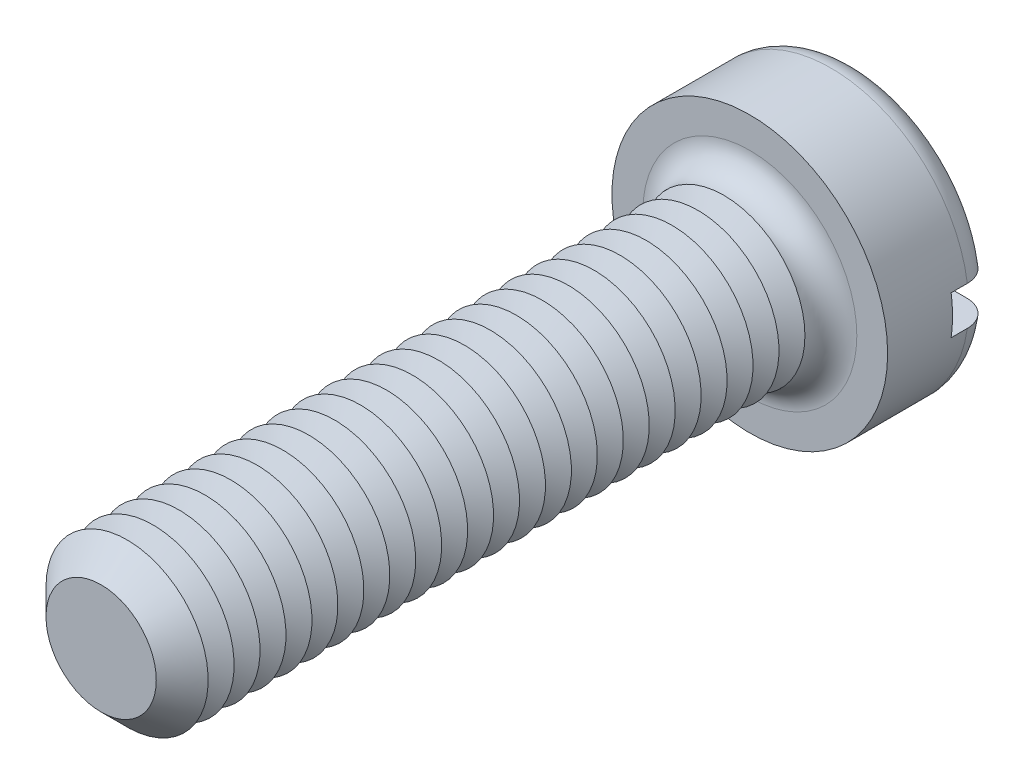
ISO-10303-21;
HEADER;
FILE_DESCRIPTION(('STEP AP214'),'2;1');
FILE_NAME('part.step','',(''),(''),'','','');
FILE_SCHEMA(('AUTOMOTIVE_DESIGN { 1 0 10303 214 1 1 1 1 }'));
ENDSEC;
DATA;
#1=APPLICATION_CONTEXT('core data for automotive mechanical design processes');
#2=APPLICATION_PROTOCOL_DEFINITION('international standard','automotive_design',2000,#1);
#3=PRODUCT_CONTEXT('',#1,'mechanical');
#4=PRODUCT('Part','Part','',(#3));
#5=PRODUCT_RELATED_PRODUCT_CATEGORY('part','',(#4));
#6=PRODUCT_DEFINITION_FORMATION('','',#4);
#7=PRODUCT_DEFINITION_CONTEXT('part definition',#1,'design');
#8=PRODUCT_DEFINITION('design','',#6,#7);
#9=PRODUCT_DEFINITION_SHAPE('','',#8);
#10=(LENGTH_UNIT() NAMED_UNIT(*) SI_UNIT(.MILLI.,.METRE.));
#11=(NAMED_UNIT(*) PLANE_ANGLE_UNIT() SI_UNIT($,.RADIAN.));
#12=(NAMED_UNIT(*) SI_UNIT($,.STERADIAN.) SOLID_ANGLE_UNIT());
#13=UNCERTAINTY_MEASURE_WITH_UNIT(LENGTH_MEASURE(1.E-05),#10,'distance_accuracy_value','');
#14=(GEOMETRIC_REPRESENTATION_CONTEXT(3) GLOBAL_UNCERTAINTY_ASSIGNED_CONTEXT((#13)) GLOBAL_UNIT_ASSIGNED_CONTEXT((#10,
#11,#12)) REPRESENTATION_CONTEXT('',''));
#15=CARTESIAN_POINT('',(0.,0.,0.));
#16=DIRECTION('',(0.,0.,1.));
#17=DIRECTION('',(1.,0.,0.));
#18=AXIS2_PLACEMENT_3D('',#15,#16,#17);
#19=CARTESIAN_POINT('',(0.,0.,-3.3));
#20=DIRECTION('',(0.,0.,1.));
#21=DIRECTION('',(1.,0.,0.));
#22=AXIS2_PLACEMENT_3D('',#19,#20,#21);
#23=PLANE('',#22);
#24=CARTESIAN_POINT('',(0.,0.,-3.3));
#25=DIRECTION('',(0.,0.,1.));
#26=DIRECTION('',(1.,0.,0.));
#27=AXIS2_PLACEMENT_3D('',#24,#25,#26);
#28=CIRCLE('',#27,3.45);
#29=CARTESIAN_POINT('',(-3.39742549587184,0.6,-3.3));
#30=VERTEX_POINT('',#29);
#31=CARTESIAN_POINT('',(3.39742549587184,0.6,-3.3));
#32=VERTEX_POINT('',#31);
#33=EDGE_CURVE('E116',#30,#32,#28,.F.);
#34=ORIENTED_EDGE('',*,*,#33,.T.);
#35=DIRECTION('',(1.,0.,0.));
#36=VECTOR('',#35,1.);
#37=CARTESIAN_POINT('',(-4.25,0.600000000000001,-3.3));
#38=LINE('',#37,#36);
#39=EDGE_CURVE('E111',#30,#32,#38,.T.);
#40=ORIENTED_EDGE('',*,*,#39,.F.);
#41=EDGE_LOOP('',(#34,#40));
#42=FACE_BOUND('',#41,.T.);
#43=ADVANCED_FACE('F39',(#42),#23,.F.);
#44=CARTESIAN_POINT('',(0.,0.,-2.5));
#45=DIRECTION('',(0.,0.,1.));
#46=DIRECTION('',(1.,0.,0.));
#47=AXIS2_PLACEMENT_3D('',#44,#45,#46);
#48=TOROIDAL_SURFACE('',#47,3.45,0.8);
#49=CARTESIAN_POINT('',(-4.06369072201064,0.600000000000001,-2.95537828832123));
#50=CARTESIAN_POINT('',(-4.03774340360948,0.600000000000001,-2.99245078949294));
#51=CARTESIAN_POINT('',(-4.00861849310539,0.600000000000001,-3.02734231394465));
#52=CARTESIAN_POINT('',(-3.94488199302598,0.600000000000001,-3.0917502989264));
#53=CARTESIAN_POINT('',(-3.91026320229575,0.600000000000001,-3.12125959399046));
#54=CARTESIAN_POINT('',(-3.83660561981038,0.600000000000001,-3.17403695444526));
#55=CARTESIAN_POINT('',(-3.79757117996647,0.6,-3.19731109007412));
#56=CARTESIAN_POINT('',(-3.71618817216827,0.6,-3.23703443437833));
#57=CARTESIAN_POINT('',(-3.67384041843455,0.6,-3.25348531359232));
#58=CARTESIAN_POINT('',(-3.58661930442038,0.6,-3.2792758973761));
#59=CARTESIAN_POINT('',(-3.54172669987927,0.6,-3.288550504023));
#60=CARTESIAN_POINT('',(-3.45102322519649,0.6,-3.29952632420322));
#61=CARTESIAN_POINT('',(-3.40521225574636,0.6,-3.30122671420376));
#62=CARTESIAN_POINT('',(-3.31340831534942,0.6,-3.29701196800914));
#63=CARTESIAN_POINT('',(-3.26741940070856,0.6,-3.29100823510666));
#64=CARTESIAN_POINT('',(-3.17708556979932,0.6,-3.27141469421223));
#65=CARTESIAN_POINT('',(-3.13274074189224,0.6,-3.25782447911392));
#66=CARTESIAN_POINT('',(-3.0466814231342,0.6,-3.22332549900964));
#67=CARTESIAN_POINT('',(-3.00498444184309,0.6,-3.20237301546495));
#68=CARTESIAN_POINT('',(-2.92572251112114,0.6,-3.15372961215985));
#69=CARTESIAN_POINT('',(-2.88815755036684,0.6,-3.12603871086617));
#70=CARTESIAN_POINT('',(-2.81847654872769,0.6,-3.06483322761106));
#71=CARTESIAN_POINT('',(-2.78633186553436,0.6,-3.03135128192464));
#72=CARTESIAN_POINT('',(-2.72824805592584,0.6,-2.95937651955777));
#73=CARTESIAN_POINT('',(-2.70230829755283,0.6,-2.92088421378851));
#74=CARTESIAN_POINT('',(-2.65791262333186,0.6,-2.84074227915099));
#75=CARTESIAN_POINT('',(-2.63932560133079,0.6,-2.79916531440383));
#76=CARTESIAN_POINT('',(-2.60958432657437,0.6,-2.7134333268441));
#77=CARTESIAN_POINT('',(-2.59842889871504,0.6,-2.66927871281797));
#78=CARTESIAN_POINT('',(-2.58411140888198,0.6,-2.58073966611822));
#79=CARTESIAN_POINT('',(-2.58077086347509,0.6,-2.5363840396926));
#80=CARTESIAN_POINT('',(-2.58167367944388,0.6,-2.44775208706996));
#81=CARTESIAN_POINT('',(-2.58591644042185,0.6,-2.40347575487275));
#82=CARTESIAN_POINT('',(-2.60175154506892,0.6,-2.31675105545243));
#83=CARTESIAN_POINT('',(-2.61326489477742,0.6,-2.27428821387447));
#84=CARTESIAN_POINT('',(-2.6431863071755,0.6,-2.19186794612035));
#85=CARTESIAN_POINT('',(-2.66159465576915,0.6,-2.15191062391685));
#86=CARTESIAN_POINT('',(-2.70494650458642,0.6,-2.07517696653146));
#87=CARTESIAN_POINT('',(-2.72995486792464,0.6,-2.03843731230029));
#88=CARTESIAN_POINT('',(-2.7856570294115,0.6,-1.96955746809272));
#89=CARTESIAN_POINT('',(-2.81635145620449,0.6,-1.93741778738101));
#90=CARTESIAN_POINT('',(-2.88329572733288,0.6,-1.87788048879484));
#91=CARTESIAN_POINT('',(-2.91965530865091,0.6,-1.85060625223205));
#92=CARTESIAN_POINT('',(-2.9963658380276,0.6,-1.80241044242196));
#93=CARTESIAN_POINT('',(-3.03671721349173,0.6,-1.78148955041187));
#94=CARTESIAN_POINT('',(-3.12111125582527,0.6,-1.74619829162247));
#95=CARTESIAN_POINT('',(-3.16521020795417,0.6,-1.73196239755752));
#96=CARTESIAN_POINT('',(-3.25516487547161,0.6,-1.71103773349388));
#97=CARTESIAN_POINT('',(-3.30102068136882,0.6,-1.70434935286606));
#98=CARTESIAN_POINT('',(-3.39352689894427,0.6,-1.69870104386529));
#99=CARTESIAN_POINT('',(-3.44018061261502,0.6,-1.69979487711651));
#100=CARTESIAN_POINT('',(-3.53263583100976,0.6,-1.70983959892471));
#101=CARTESIAN_POINT('',(-3.57843734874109,0.6,-1.71879036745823));
#102=CARTESIAN_POINT('',(-3.66763544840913,0.6,-1.74426972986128));
#103=CARTESIAN_POINT('',(-3.71104292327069,0.6,-1.76076015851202));
#104=CARTESIAN_POINT('',(-3.79442616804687,0.6,-1.80087686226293));
#105=CARTESIAN_POINT('',(-3.83440212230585,0.600000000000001,-1.82450275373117));
#106=CARTESIAN_POINT('',(-3.90929765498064,0.600000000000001,-1.87793548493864));
#107=CARTESIAN_POINT('',(-3.94426963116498,0.600000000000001,-1.90766887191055));
#108=CARTESIAN_POINT('',(-4.00864839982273,0.600000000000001,-1.9726503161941));
#109=CARTESIAN_POINT('',(-4.03805555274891,0.600000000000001,-2.00789801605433));
#110=CARTESIAN_POINT('',(-4.09009460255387,0.600000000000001,-2.08244463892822));
#111=CARTESIAN_POINT('',(-4.11280448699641,0.600000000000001,-2.12168912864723));
#112=CARTESIAN_POINT('',(-4.15124086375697,0.600000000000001,-2.2034588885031));
#113=CARTESIAN_POINT('',(-4.16696802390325,0.600000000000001,-2.24598384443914));
#114=CARTESIAN_POINT('',(-4.19085131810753,0.600000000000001,-2.33267862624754));
#115=CARTESIAN_POINT('',(-4.19907708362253,0.600000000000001,-2.37682928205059));
#116=CARTESIAN_POINT('',(-4.2079638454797,0.600000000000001,-2.46589754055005));
#117=CARTESIAN_POINT('',(-4.20862315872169,0.600000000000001,-2.51081531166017));
#118=CARTESIAN_POINT('',(-4.20236829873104,0.600000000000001,-2.59993343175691));
#119=CARTESIAN_POINT('',(-4.19548454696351,0.600000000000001,-2.64413593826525));
#120=CARTESIAN_POINT('',(-4.17439924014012,0.600000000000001,-2.73071930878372));
#121=CARTESIAN_POINT('',(-4.16020675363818,0.600000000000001,-2.77310235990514));
#122=CARTESIAN_POINT('',(-4.1318825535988,0.600000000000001,-2.83880495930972));
#123=CARTESIAN_POINT('',(-4.11991183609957,0.600000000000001,-2.86307959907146));
#124=CARTESIAN_POINT('',(-4.09356927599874,0.600000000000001,-2.91028856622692));
#125=CARTESIAN_POINT('',(-4.07919744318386,0.600000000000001,-2.9332228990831));
#126=CARTESIAN_POINT('',(-4.06369072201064,0.600000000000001,-2.95537828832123));
#127=B_SPLINE_CURVE_WITH_KNOTS('',3,(#49,#50,#51,#52,#53,#54,#55,#56,#57,#58,#59,#60,#61,#62,
#63,#64,#65,#66,#67,#68,#69,#70,#71,#72,#73,#74,#75,#76,#77,#78,#79,#80,#81,#82,#83,#84,#85,#86,
#87,#88,#89,#90,#91,#92,#93,#94,#95,#96,#97,#98,#99,#100,#101,#102,#103,#104,#105,#106,#107,
#108,#109,#110,#111,#112,#113,#114,#115,#116,#117,#118,#119,#120,#121,#122,#123,#124,#125,#126),
.UNSPECIFIED.,.T.,.F.,(4,2,2,2,2,2,2,2,2,2,2,2,2,2,2,2,2,2,2,2,2,2,2,2,2,2,2,2,2,2,2,2,2,2,2,2,
2,2,4),(0.,0.13565225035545,0.271483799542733,0.407182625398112,0.542848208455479,
0.679730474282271,0.816627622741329,0.955113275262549,1.09360635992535,1.23293614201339,
1.37226554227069,1.51083389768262,1.64938813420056,1.78534653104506,1.92128342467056,
2.0540840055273,2.18687407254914,2.31824564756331,2.44962267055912,2.58234229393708,
2.71507659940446,2.85080630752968,2.98655056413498,3.12491938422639,3.26329534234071,
3.40262816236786,3.54195885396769,3.68059194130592,3.81921757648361,3.95626453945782,
4.09330262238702,4.2286754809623,4.36403538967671,4.49812564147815,4.63224572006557,
4.76582687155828,4.89924267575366,4.98031194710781,5.0613808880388),.UNSPECIFIED.);
#128=CARTESIAN_POINT('',(-4.20743389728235,0.600000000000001,-2.50000000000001));
#129=VERTEX_POINT('',#128);
#130=EDGE_CURVE('E363',#129,#30,#127,.T.);
#131=ORIENTED_EDGE('',*,*,#130,.F.);
#132=CARTESIAN_POINT('',(0.,0.,-2.5));
#133=DIRECTION('',(0.,0.,1.));
#134=DIRECTION('',(1.,0.,0.));
#135=AXIS2_PLACEMENT_3D('',#132,#133,#134);
#136=CIRCLE('',#135,4.25);
#137=CARTESIAN_POINT('',(4.20743389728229,0.599999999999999,-2.5));
#138=VERTEX_POINT('',#137);
#139=EDGE_CURVE('E125',#138,#129,#136,.T.);
#140=ORIENTED_EDGE('',*,*,#139,.F.);
#141=CARTESIAN_POINT('',(2.63947327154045,0.6,-2.79608831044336));
#142=CARTESIAN_POINT('',(2.65655980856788,0.6,-2.83790320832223));
#143=CARTESIAN_POINT('',(2.67725642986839,0.6,-2.87828303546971));
#144=CARTESIAN_POINT('',(2.72519250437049,0.6,-2.95500233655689));
#145=CARTESIAN_POINT('',(2.75244152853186,0.6,-2.9913357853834));
#146=CARTESIAN_POINT('',(2.81257938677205,0.6,-3.05889430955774));
#147=CARTESIAN_POINT('',(2.84545995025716,0.6,-3.09012674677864));
#148=CARTESIAN_POINT('',(2.91591143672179,0.6,-3.14672620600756));
#149=CARTESIAN_POINT('',(2.95348119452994,0.6,-3.17209468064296));
#150=CARTESIAN_POINT('',(3.03291143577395,0.6,-3.21669611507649));
#151=CARTESIAN_POINT('',(3.07483186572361,0.6,-3.23582234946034));
#152=CARTESIAN_POINT('',(3.16126659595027,0.6,-3.26686062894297));
#153=CARTESIAN_POINT('',(3.2057811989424,0.6,-3.27877183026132));
#154=CARTESIAN_POINT('',(3.29669878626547,0.6,-3.29514603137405));
#155=CARTESIAN_POINT('',(3.34311773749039,0.6,-3.29952056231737));
#156=CARTESIAN_POINT('',(3.43603189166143,0.6,-3.30040472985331));
#157=CARTESIAN_POINT('',(3.48252709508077,0.6,-3.29691431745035));
#158=CARTESIAN_POINT('',(3.57420049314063,0.6,-3.28214240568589));
#159=CARTESIAN_POINT('',(3.61938038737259,0.6,-3.27087147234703));
#160=CARTESIAN_POINT('',(3.70717477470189,0.6,-3.24082890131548));
#161=CARTESIAN_POINT('',(3.74978938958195,0.6,-3.22205762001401));
#162=CARTESIAN_POINT('',(3.83078828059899,0.6,-3.17773607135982));
#163=CARTESIAN_POINT('',(3.86921015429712,0.599999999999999,-3.15225453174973));
#164=CARTESIAN_POINT('',(3.94116038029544,0.599999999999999,-3.09512672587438));
#165=CARTESIAN_POINT('',(3.9746890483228,0.599999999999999,-3.06348085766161));
#166=CARTESIAN_POINT('',(4.03545911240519,0.599999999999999,-2.99534640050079));
#167=CARTESIAN_POINT('',(4.06277344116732,0.599999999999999,-2.95892285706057));
#168=CARTESIAN_POINT('',(4.11082191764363,0.599999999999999,-2.88196698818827));
#169=CARTESIAN_POINT('',(4.13155647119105,0.599999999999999,-2.84143491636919));
#170=CARTESIAN_POINT('',(4.16563480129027,0.599999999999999,-2.75787550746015));
#171=CARTESIAN_POINT('',(4.1790544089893,0.599999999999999,-2.71487908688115));
#172=CARTESIAN_POINT('',(4.19843340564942,0.599999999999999,-2.62723691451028));
#173=CARTESIAN_POINT('',(4.20439310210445,0.599999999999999,-2.58259123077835));
#174=CARTESIAN_POINT('',(4.2086595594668,0.599999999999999,-2.49321831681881));
#175=CARTESIAN_POINT('',(4.20701422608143,0.599999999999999,-2.4484933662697));
#176=CARTESIAN_POINT('',(4.1962295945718,0.599999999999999,-2.35995704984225));
#177=CARTESIAN_POINT('',(4.18709040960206,0.599999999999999,-2.31614567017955));
#178=CARTESIAN_POINT('',(4.16160290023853,0.599999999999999,-2.23072100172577));
#179=CARTESIAN_POINT('',(4.14526169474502,0.599999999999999,-2.18910558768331));
#180=CARTESIAN_POINT('',(4.10585410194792,0.599999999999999,-2.10919238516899));
#181=CARTESIAN_POINT('',(4.08278762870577,0.599999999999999,-2.07089463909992));
#182=CARTESIAN_POINT('',(4.030487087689,0.599999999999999,-1.99851484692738));
#183=CARTESIAN_POINT('',(4.00122628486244,0.599999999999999,-1.9644521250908));
#184=CARTESIAN_POINT('',(3.93744772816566,0.599999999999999,-1.90166877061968));
#185=CARTESIAN_POINT('',(3.90292977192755,0.599999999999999,-1.87294834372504));
#186=CARTESIAN_POINT('',(3.82928727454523,0.599999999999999,-1.82137853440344));
#187=CARTESIAN_POINT('',(3.79012374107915,0.6,-1.79858484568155));
#188=CARTESIAN_POINT('',(3.70856025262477,0.6,-1.75980712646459));
#189=CARTESIAN_POINT('',(3.66616010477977,0.6,-1.74382350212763));
#190=CARTESIAN_POINT('',(3.57878495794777,0.6,-1.71891499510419));
#191=CARTESIAN_POINT('',(3.53378519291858,0.6,-1.71007699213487));
#192=CARTESIAN_POINT('',(3.44294322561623,0.6,-1.69998722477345));
#193=CARTESIAN_POINT('',(3.3971009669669,0.6,-1.69873596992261));
#194=CARTESIAN_POINT('',(3.30531297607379,0.6,-1.70385439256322));
#195=CARTESIAN_POINT('',(3.25937213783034,0.6,-1.71031204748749));
#196=CARTESIAN_POINT('',(3.1692099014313,0.6,-1.73080107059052));
#197=CARTESIAN_POINT('',(3.12498860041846,0.6,-1.74483286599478));
#198=CARTESIAN_POINT('',(3.03926209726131,0.6,-1.78018941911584));
#199=CARTESIAN_POINT('',(2.99777407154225,0.6,-1.80155586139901));
#200=CARTESIAN_POINT('',(2.91899881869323,0.6,-1.85098881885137));
#201=CARTESIAN_POINT('',(2.88171158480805,0.6,-1.8790553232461));
#202=CARTESIAN_POINT('',(2.81266124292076,0.6,-1.94094884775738));
#203=CARTESIAN_POINT('',(2.78086710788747,0.6,-1.97474122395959));
#204=CARTESIAN_POINT('',(2.72353615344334,0.6,-2.0472724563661));
#205=CARTESIAN_POINT('',(2.69799841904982,0.6,-2.08601058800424));
#206=CARTESIAN_POINT('',(2.65444718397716,0.6,-2.16655019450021));
#207=CARTESIAN_POINT('',(2.63629889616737,0.6,-2.20827875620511));
#208=CARTESIAN_POINT('',(2.60744942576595,0.6,-2.29424821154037));
#209=CARTESIAN_POINT('',(2.59674901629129,0.6,-2.33848936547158));
#210=CARTESIAN_POINT('',(2.5833312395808,0.6,-2.42714258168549));
#211=CARTESIAN_POINT('',(2.58043995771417,0.6,-2.47152848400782));
#212=CARTESIAN_POINT('',(2.58224493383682,0.6,-2.56010574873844));
#213=CARTESIAN_POINT('',(2.58693104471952,0.6,-2.60429729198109));
#214=CARTESIAN_POINT('',(2.60020046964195,0.6,-2.67311978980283));
#215=CARTESIAN_POINT('',(2.60635343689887,0.6,-2.69824441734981));
#216=CARTESIAN_POINT('',(2.62110140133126,0.6,-2.74776540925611));
#217=CARTESIAN_POINT('',(2.62969634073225,0.6,-2.77216179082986));
#218=CARTESIAN_POINT('',(2.63947327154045,0.6,-2.79608831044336));
#219=B_SPLINE_CURVE_WITH_KNOTS('',3,(#141,#142,#143,#144,#145,#146,#147,#148,#149,#150,#151,
#152,#153,#154,#155,#156,#157,#158,#159,#160,#161,#162,#163,#164,#165,#166,#167,#168,#169,#170,
#171,#172,#173,#174,#175,#176,#177,#178,#179,#180,#181,#182,#183,#184,#185,#186,#187,#188,#189,
#190,#191,#192,#193,#194,#195,#196,#197,#198,#199,#200,#201,#202,#203,#204,#205,#206,#207,#208,
#209,#210,#211,#212,#213,#214,#215,#216,#217,#218),.UNSPECIFIED.,.T.,.F.,(4,2,2,2,2,2,2,2,2,2,2,
2,2,2,2,2,2,2,2,2,2,2,2,2,2,2,2,2,2,2,2,2,2,2,2,2,2,2,4),(0.,0.135416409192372,
0.271031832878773,0.406449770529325,0.541834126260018,0.679424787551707,0.817031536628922,
0.956242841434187,1.09545501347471,1.23447850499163,1.37349539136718,1.51114036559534,
1.64877645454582,1.78470267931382,1.92062051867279,2.05510117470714,2.1895762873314,
2.32320547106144,2.45683263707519,2.59032801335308,2.72382509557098,2.85791055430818,
2.99200117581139,3.12730969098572,3.26262627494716,3.39956435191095,3.53651162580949,
3.67503685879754,3.81356990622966,3.95290367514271,4.09223721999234,4.23075602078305,
4.36925455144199,4.50509949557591,4.6409585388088,4.77376594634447,4.90639565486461,
4.98388287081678,5.06136825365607),.UNSPECIFIED.);
#220=EDGE_CURVE('E365',#32,#138,#219,.T.);
#221=ORIENTED_EDGE('',*,*,#220,.F.);
#222=ORIENTED_EDGE('',*,*,#33,.F.);
#223=EDGE_LOOP('',(#131,#140,#221,#222));
#224=FACE_BOUND('',#223,.T.);
#225=ADVANCED_FACE('F347',(#224),#48,.T.);
#226=CARTESIAN_POINT('',(0.,0.,-3.3));
#227=DIRECTION('',(0.,0.,1.));
#228=DIRECTION('',(1.,0.,0.));
#229=AXIS2_PLACEMENT_3D('',#226,#227,#228);
#230=CYLINDRICAL_SURFACE('',#229,4.25);
#231=DIRECTION('',(0.,0.,1.));
#232=VECTOR('',#231,1.);
#233=CARTESIAN_POINT('',(4.20743389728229,0.599999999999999,-3.3));
#234=LINE('',#233,#232);
#235=CARTESIAN_POINT('',(4.20743389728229,0.599999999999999,-2.));
#236=VERTEX_POINT('',#235);
#237=EDGE_CURVE('E381',#138,#236,#234,.T.);
#238=ORIENTED_EDGE('',*,*,#237,.F.);
#239=ORIENTED_EDGE('',*,*,#139,.T.);
#240=DIRECTION('',(0.,0.,1.));
#241=VECTOR('',#240,1.);
#242=CARTESIAN_POINT('',(-4.20743389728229,0.600000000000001,-3.3));
#243=LINE('',#242,#241);
#244=CARTESIAN_POINT('',(-4.20743389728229,0.600000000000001,-2.));
#245=VERTEX_POINT('',#244);
#246=EDGE_CURVE('E63',#245,#129,#243,.F.);
#247=ORIENTED_EDGE('',*,*,#246,.F.);
#248=CARTESIAN_POINT('',(0.,0.,-2.));
#249=DIRECTION('',(0.,0.,-1.));
#250=DIRECTION('',(-1.,0.,0.));
#251=AXIS2_PLACEMENT_3D('',#248,#249,#250);
#252=CIRCLE('',#251,4.25);
#253=CARTESIAN_POINT('',(-4.20743389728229,-0.599999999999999,-2.));
#254=VERTEX_POINT('',#253);
#255=EDGE_CURVE('E43',#245,#254,#252,.F.);
#256=ORIENTED_EDGE('',*,*,#255,.T.);
#257=DIRECTION('',(0.,0.,1.));
#258=VECTOR('',#257,1.);
#259=CARTESIAN_POINT('',(-4.20743389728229,-0.599999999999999,-3.3));
#260=LINE('',#259,#258);
#261=CARTESIAN_POINT('',(-4.20743389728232,-0.599999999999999,-2.5));
#262=VERTEX_POINT('',#261);
#263=EDGE_CURVE('E378',#262,#254,#260,.T.);
#264=ORIENTED_EDGE('',*,*,#263,.F.);
#265=CARTESIAN_POINT('',(4.20743389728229,-0.600000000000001,-2.5));
#266=VERTEX_POINT('',#265);
#267=EDGE_CURVE('E127',#262,#266,#136,.T.);
#268=ORIENTED_EDGE('',*,*,#267,.T.);
#269=DIRECTION('',(0.,0.,1.));
#270=VECTOR('',#269,1.);
#271=CARTESIAN_POINT('',(4.20743389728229,-0.600000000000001,-3.3));
#272=LINE('',#271,#270);
#273=CARTESIAN_POINT('',(4.20743389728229,-0.600000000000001,-2.));
#274=VERTEX_POINT('',#273);
#275=EDGE_CURVE('E55',#274,#266,#272,.F.);
#276=ORIENTED_EDGE('',*,*,#275,.F.);
#277=EDGE_CURVE('E11',#274,#236,#252,.F.);
#278=ORIENTED_EDGE('',*,*,#277,.T.);
#279=EDGE_LOOP('',(#238,#239,#247,#256,#264,#268,#276,#278));
#280=FACE_BOUND('',#279,.T.);
#281=CARTESIAN_POINT('',(0.,0.,0.));
#282=DIRECTION('',(0.,0.,1.));
#283=DIRECTION('',(1.,0.,0.));
#284=AXIS2_PLACEMENT_3D('',#281,#282,#283);
#285=CIRCLE('',#284,4.25);
#286=CARTESIAN_POINT('',(4.25,0.,0.));
#287=VERTEX_POINT('',#286);
#288=EDGE_CURVE('E384',#287,#287,#285,.T.);
#289=ORIENTED_EDGE('',*,*,#288,.F.);
#290=EDGE_LOOP('',(#289));
#291=FACE_BOUND('',#290,.T.);
#292=ADVANCED_FACE('F343',(#280,#291),#230,.T.);
#293=CARTESIAN_POINT('',(3.39742549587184,-0.6,-3.3));
#294=VERTEX_POINT('',#293);
#295=CARTESIAN_POINT('',(-3.39742549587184,-0.6,-3.3));
#296=VERTEX_POINT('',#295);
#297=EDGE_CURVE('E109',#294,#296,#28,.F.);
#298=ORIENTED_EDGE('',*,*,#297,.T.);
#299=DIRECTION('',(-1.,0.,0.));
#300=VECTOR('',#299,1.);
#301=CARTESIAN_POINT('',(-4.25,-0.599999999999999,-3.3));
#302=LINE('',#301,#300);
#303=EDGE_CURVE('E96',#294,#296,#302,.T.);
#304=ORIENTED_EDGE('',*,*,#303,.F.);
#305=EDGE_LOOP('',(#298,#304));
#306=FACE_BOUND('',#305,.T.);
#307=ADVANCED_FACE('F108',(#306),#23,.F.);
#308=CARTESIAN_POINT('',(0.,0.,0.));
#309=DIRECTION('',(0.,0.,1.));
#310=DIRECTION('',(1.,0.,0.));
#311=AXIS2_PLACEMENT_3D('',#308,#309,#310);
#312=PLANE('',#311);
#313=CARTESIAN_POINT('',(0.,0.,0.));
#314=DIRECTION('',(0.,0.,1.));
#315=DIRECTION('',(1.,0.,0.));
#316=AXIS2_PLACEMENT_3D('',#313,#314,#315);
#317=CIRCLE('',#316,3.3);
#318=CARTESIAN_POINT('',(3.3,0.,0.));
#319=VERTEX_POINT('',#318);
#320=EDGE_CURVE('E115',#319,#319,#317,.F.);
#321=ORIENTED_EDGE('',*,*,#320,.T.);
#322=EDGE_LOOP('',(#321));
#323=FACE_BOUND('',#322,.T.);
#324=ORIENTED_EDGE('',*,*,#288,.T.);
#325=EDGE_LOOP('',(#324));
#326=FACE_BOUND('',#325,.T.);
#327=ADVANCED_FACE('F342',(#323,#326),#312,.T.);
#328=CARTESIAN_POINT('',(-4.06369072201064,-0.599999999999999,-2.95537828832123));
#329=CARTESIAN_POINT('',(-4.08928577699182,-0.599999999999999,-2.91880204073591));
#330=CARTESIAN_POINT('',(-4.11182555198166,-0.599999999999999,-2.88005030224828));
#331=CARTESIAN_POINT('',(-4.15010404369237,-0.599999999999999,-2.79928452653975));
#332=CARTESIAN_POINT('',(-4.16583526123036,-0.599999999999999,-2.75726695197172));
#333=CARTESIAN_POINT('',(-4.19000286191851,-0.599999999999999,-2.67118996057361));
#334=CARTESIAN_POINT('',(-4.19844101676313,-0.599999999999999,-2.62713104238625));
#335=CARTESIAN_POINT('',(-4.20777174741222,-0.599999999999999,-2.53823222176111));
#336=CARTESIAN_POINT('',(-4.20866608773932,-0.599999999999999,-2.49339250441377));
#337=CARTESIAN_POINT('',(-4.20289683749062,-0.599999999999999,-2.40433856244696));
#338=CARTESIAN_POINT('',(-4.19625607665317,-0.599999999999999,-2.36012285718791));
#339=CARTESIAN_POINT('',(-4.17565084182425,-0.599999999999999,-2.27343166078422));
#340=CARTESIAN_POINT('',(-4.16168615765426,-0.599999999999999,-2.23095621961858));
#341=CARTESIAN_POINT('',(-4.12683188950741,-0.599999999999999,-2.14890863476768));
#342=CARTESIAN_POINT('',(-4.10593663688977,-0.599999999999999,-2.10933890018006));
#343=CARTESIAN_POINT('',(-4.05783763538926,-0.599999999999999,-2.03424145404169));
#344=CARTESIAN_POINT('',(-4.03063375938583,-0.599999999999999,-1.99871382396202));
#345=CARTESIAN_POINT('',(-3.97052236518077,-0.599999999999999,-1.93246905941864));
#346=CARTESIAN_POINT('',(-3.93758114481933,-0.599999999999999,-1.90178251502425));
#347=CARTESIAN_POINT('',(-3.86706007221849,-0.599999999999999,-1.84630837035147));
#348=CARTESIAN_POINT('',(-3.82948001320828,-0.6,-1.82152103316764));
#349=CARTESIAN_POINT('',(-3.75033766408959,-0.6,-1.77826995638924));
#350=CARTESIAN_POINT('',(-3.70873831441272,-0.6,-1.7598740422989));
#351=CARTESIAN_POINT('',(-3.62306661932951,-0.6,-1.73023196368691));
#352=CARTESIAN_POINT('',(-3.57899411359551,-0.6,-1.71898626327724));
#353=CARTESIAN_POINT('',(-3.48904845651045,-0.6,-1.70382025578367));
#354=CARTESIAN_POINT('',(-3.44315982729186,-0.6,-1.69999172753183));
#355=CARTESIAN_POINT('',(-3.35138360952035,-0.6,-1.7000083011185));
#356=CARTESIAN_POINT('',(-3.30549602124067,-0.6,-1.70385391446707));
#357=CARTESIAN_POINT('',(-3.21452492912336,-0.6,-1.71917227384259));
#358=CARTESIAN_POINT('',(-3.16945455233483,-0.6,-1.73072307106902));
#359=CARTESIAN_POINT('',(-3.08188104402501,-0.6,-1.76120640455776));
#360=CARTESIAN_POINT('',(-3.0393780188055,-0.6,-1.78013924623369));
#361=CARTESIAN_POINT('',(-2.95805296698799,-0.6,-1.82493384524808));
#362=CARTESIAN_POINT('',(-2.9192403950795,-0.6,-1.85081278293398));
#363=CARTESIAN_POINT('',(-2.84656695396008,-0.6,-1.90878317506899));
#364=CARTESIAN_POINT('',(-2.81270591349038,-0.6,-1.94087441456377));
#365=CARTESIAN_POINT('',(-2.75131050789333,-0.6,-2.01002500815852));
#366=CARTESIAN_POINT('',(-2.72371339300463,-0.6,-2.04702860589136));
#367=CARTESIAN_POINT('',(-2.67528742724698,-0.6,-2.12522869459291));
#368=CARTESIAN_POINT('',(-2.65445765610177,-0.6,-2.1664246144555));
#369=CARTESIAN_POINT('',(-2.62065354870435,-0.6,-2.25087266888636));
#370=CARTESIAN_POINT('',(-2.60751663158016,-0.6,-2.29405971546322));
#371=CARTESIAN_POINT('',(-2.58885106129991,-0.6,-2.38204659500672));
#372=CARTESIAN_POINT('',(-2.58332131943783,-0.6,-2.42684619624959));
#373=CARTESIAN_POINT('',(-2.58009777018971,-0.6,-2.51580379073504));
#374=CARTESIAN_POINT('',(-2.58224575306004,-0.6,-2.55995612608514));
#375=CARTESIAN_POINT('',(-2.59395205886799,-0.6,-2.64726495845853));
#376=CARTESIAN_POINT('',(-2.60351013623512,-0.6,-2.69042148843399));
#377=CARTESIAN_POINT('',(-2.62967159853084,-0.6,-2.77438771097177));
#378=CARTESIAN_POINT('',(-2.64625243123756,-0.6,-2.81520444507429));
#379=CARTESIAN_POINT('',(-2.68592348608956,-0.6,-2.89353901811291));
#380=CARTESIAN_POINT('',(-2.70901418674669,-0.6,-2.9310566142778));
#381=CARTESIAN_POINT('',(-2.7614318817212,-0.6,-3.00240040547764));
#382=CARTESIAN_POINT('',(-2.79085487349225,-0.6,-3.03615603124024));
#383=CARTESIAN_POINT('',(-2.85483456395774,-0.6,-3.09838834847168));
#384=CARTESIAN_POINT('',(-2.88939187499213,-0.6,-3.12686440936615));
#385=CARTESIAN_POINT('',(-2.96351967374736,-0.6,-3.17841283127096));
#386=CARTESIAN_POINT('',(-3.00318741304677,-0.6,-3.20134539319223));
#387=CARTESIAN_POINT('',(-3.08576649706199,-0.6,-3.24034364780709));
#388=CARTESIAN_POINT('',(-3.12867814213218,-0.6,-3.25640870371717));
#389=CARTESIAN_POINT('',(-3.21724048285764,-0.6,-3.28143816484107));
#390=CARTESIAN_POINT('',(-3.26292314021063,-0.6,-3.29028963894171));
#391=CARTESIAN_POINT('',(-3.35512527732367,-0.6,-3.30021681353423));
#392=CARTESIAN_POINT('',(-3.40164474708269,-0.6,-3.30129260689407));
#393=CARTESIAN_POINT('',(-3.49429978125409,-0.6,-3.29560589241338));
#394=CARTESIAN_POINT('',(-3.54043436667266,-0.6,-3.28882735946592));
#395=CARTESIAN_POINT('',(-3.63090382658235,-0.6,-3.26755492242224));
#396=CARTESIAN_POINT('',(-3.67523831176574,-0.6,-3.25305935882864));
#397=CARTESIAN_POINT('',(-3.76046509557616,-0.6,-3.21686867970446));
#398=CARTESIAN_POINT('',(-3.80138087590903,-0.599999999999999,-3.1952288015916));
#399=CARTESIAN_POINT('',(-3.8788986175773,-0.599999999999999,-3.14531817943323));
#400=CARTESIAN_POINT('',(-3.91550599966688,-0.599999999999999,-3.11705590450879));
#401=CARTESIAN_POINT('',(-3.97074313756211,-0.599999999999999,-3.06628809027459));
#402=CARTESIAN_POINT('',(-3.99100743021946,-0.599999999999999,-3.04553102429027));
#403=CARTESIAN_POINT('',(-4.02917385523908,-0.599999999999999,-3.00194762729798));
#404=CARTESIAN_POINT('',(-4.04707600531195,-0.599999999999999,-2.97912131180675));
#405=CARTESIAN_POINT('',(-4.06369072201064,-0.599999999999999,-2.95537828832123));
#406=B_SPLINE_CURVE_WITH_KNOTS('',3,(#328,#329,#330,#331,#332,#333,#334,#335,#336,#337,#338,
#339,#340,#341,#342,#343,#344,#345,#346,#347,#348,#349,#350,#351,#352,#353,#354,#355,#356,#357,
#358,#359,#360,#361,#362,#363,#364,#365,#366,#367,#368,#369,#370,#371,#372,#373,#374,#375,#376,
#377,#378,#379,#380,#381,#382,#383,#384,#385,#386,#387,#388,#389,#390,#391,#392,#393,#394,#395,
#396,#397,#398,#399,#400,#401,#402,#403,#404,#405),.UNSPECIFIED.,.T.,.F.,(4,2,2,2,2,2,2,2,2,2,2,
2,2,2,2,2,2,2,2,2,2,2,2,2,2,2,2,2,2,2,2,2,2,2,2,2,2,2,4),(0.,0.133821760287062,
0.267790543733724,0.401726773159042,0.535631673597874,0.669131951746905,0.802636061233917,
0.936249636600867,1.06986590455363,1.2042952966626,1.3387306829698,1.47455198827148,
1.61038210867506,1.74788249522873,1.88539204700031,2.02431612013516,2.16324594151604,
2.30252260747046,2.4417944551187,2.57960263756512,2.71739207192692,2.85215325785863,
2.98689515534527,3.11887666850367,3.25085380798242,3.38241030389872,3.51397647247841,
3.64769871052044,3.78143690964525,3.91826005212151,4.05509587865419,4.19403485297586,
4.33297216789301,4.47219345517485,4.61144469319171,4.74964356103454,4.887666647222,
4.97453605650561,5.06140481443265),.UNSPECIFIED.);
#407=EDGE_CURVE('E103',#296,#262,#406,.T.);
#408=ORIENTED_EDGE('',*,*,#407,.F.);
#409=ORIENTED_EDGE('',*,*,#297,.F.);
#410=CARTESIAN_POINT('',(2.63947327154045,-0.6,-2.79608831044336));
#411=CARTESIAN_POINT('',(2.62285766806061,-0.6,-2.75541510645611));
#412=CARTESIAN_POINT('',(2.60963282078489,-0.6,-2.71332585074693));
#413=CARTESIAN_POINT('',(2.59042394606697,-0.6,-2.62749460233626));
#414=CARTESIAN_POINT('',(2.58444686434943,-0.6,-2.58375106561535));
#415=CARTESIAN_POINT('',(2.57995287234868,-0.6,-2.49588524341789));
#416=CARTESIAN_POINT('',(2.58143477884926,-0.6,-2.45176301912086));
#417=CARTESIAN_POINT('',(2.59180622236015,-0.6,-2.36440906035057));
#418=CARTESIAN_POINT('',(2.60069434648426,-0.6,-2.32117715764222));
#419=CARTESIAN_POINT('',(2.62554964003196,-0.6,-2.23689909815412));
#420=CARTESIAN_POINT('',(2.6415022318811,-0.6,-2.19584863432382));
#421=CARTESIAN_POINT('',(2.67996913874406,-0.6,-2.11694797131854));
#422=CARTESIAN_POINT('',(2.70248409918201,-0.6,-2.07909808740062));
#423=CARTESIAN_POINT('',(2.75378972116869,-0.6,-2.00702296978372));
#424=CARTESIAN_POINT('',(2.7826732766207,-0.6,-1.97286389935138));
#425=CARTESIAN_POINT('',(2.84564717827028,-0.6,-1.90974167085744));
#426=CARTESIAN_POINT('',(2.87973812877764,-0.6,-1.88077911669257));
#427=CARTESIAN_POINT('',(2.95300941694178,-0.6,-1.82817307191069));
#428=CARTESIAN_POINT('',(2.99228920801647,-0.6,-1.8046680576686));
#429=CARTESIAN_POINT('',(3.07419050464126,-0.6,-1.76446470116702));
#430=CARTESIAN_POINT('',(3.11681231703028,-0.6,-1.74776698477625));
#431=CARTESIAN_POINT('',(3.20492149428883,-0.6,-1.72140945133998));
#432=CARTESIAN_POINT('',(3.25044365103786,-0.6,-1.71186578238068));
#433=CARTESIAN_POINT('',(3.34244451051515,-0.6,-1.70053183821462));
#434=CARTESIAN_POINT('',(3.38892324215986,-0.6,-1.69874179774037));
#435=CARTESIAN_POINT('',(3.48165030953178,-0.6,-1.70299737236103));
#436=CARTESIAN_POINT('',(3.52789766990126,-0.6,-1.70906439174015));
#437=CARTESIAN_POINT('',(3.61869999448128,-0.6,-1.72893768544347));
#438=CARTESIAN_POINT('',(3.6632550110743,-0.6,-1.742743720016));
#439=CARTESIAN_POINT('',(3.7490339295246,-0.6,-1.77760539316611));
#440=CARTESIAN_POINT('',(3.79028083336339,-0.600000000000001,-1.79860440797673));
#441=CARTESIAN_POINT('',(3.86860401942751,-0.600000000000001,-1.84731105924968));
#442=CARTESIAN_POINT('',(3.90568056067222,-0.600000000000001,-1.87501827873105));
#443=CARTESIAN_POINT('',(3.97412845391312,-0.600000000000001,-1.93599408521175));
#444=CARTESIAN_POINT('',(4.00556369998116,-0.600000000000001,-1.96919094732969));
#445=CARTESIAN_POINT('',(4.06233546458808,-0.600000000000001,-2.0404445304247));
#446=CARTESIAN_POINT('',(4.08767237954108,-0.600000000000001,-2.07850093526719));
#447=CARTESIAN_POINT('',(4.13122502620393,-0.600000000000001,-2.15791791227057));
#448=CARTESIAN_POINT('',(4.14951966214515,-0.600000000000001,-2.19923522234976));
#449=CARTESIAN_POINT('',(4.17884974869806,-0.600000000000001,-2.28437065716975));
#450=CARTESIAN_POINT('',(4.18988555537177,-0.600000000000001,-2.32818865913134));
#451=CARTESIAN_POINT('',(4.20430724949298,-0.600000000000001,-2.41670951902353));
#452=CARTESIAN_POINT('',(4.2077528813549,-0.600000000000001,-2.46140265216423));
#453=CARTESIAN_POINT('',(4.20706844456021,-0.600000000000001,-2.55073028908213));
#454=CARTESIAN_POINT('',(4.20293856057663,-0.600000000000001,-2.595364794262));
#455=CARTESIAN_POINT('',(4.18724926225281,-0.600000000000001,-2.68317733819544));
#456=CARTESIAN_POINT('',(4.17571081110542,-0.600000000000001,-2.72635912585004));
#457=CARTESIAN_POINT('',(4.14556645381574,-0.600000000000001,-2.81017999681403));
#458=CARTESIAN_POINT('',(4.12696052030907,-0.600000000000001,-2.85081907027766));
#459=CARTESIAN_POINT('',(4.08317014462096,-0.600000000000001,-2.92852328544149));
#460=CARTESIAN_POINT('',(4.0579684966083,-0.600000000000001,-2.96557872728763));
#461=CARTESIAN_POINT('',(4.00174565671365,-0.600000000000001,-3.034972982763));
#462=CARTESIAN_POINT('',(3.97072429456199,-0.600000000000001,-3.06731165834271));
#463=CARTESIAN_POINT('',(3.90349659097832,-0.600000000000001,-3.12662735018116));
#464=CARTESIAN_POINT('',(3.86725240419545,-0.600000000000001,-3.15356146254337));
#465=CARTESIAN_POINT('',(3.79079809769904,-0.600000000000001,-3.20104156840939));
#466=CARTESIAN_POINT('',(3.75058775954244,-0.6,-3.22158720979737));
#467=CARTESIAN_POINT('',(3.6668595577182,-0.6,-3.25595832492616));
#468=CARTESIAN_POINT('',(3.62330947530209,-0.6,-3.26970530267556));
#469=CARTESIAN_POINT('',(3.53453348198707,-0.6,-3.28979004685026));
#470=CARTESIAN_POINT('',(3.48930745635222,-0.6,-3.29612730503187));
#471=CARTESIAN_POINT('',(3.39787506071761,-0.6,-3.30128612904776));
#472=CARTESIAN_POINT('',(3.35166346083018,-0.6,-3.30001513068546));
#473=CARTESIAN_POINT('',(3.26009663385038,-0.6,-3.28980210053));
#474=CARTESIAN_POINT('',(3.21474142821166,-0.6,-3.28085987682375));
#475=CARTESIAN_POINT('',(3.12577990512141,-0.6,-3.2554540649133));
#476=CARTESIAN_POINT('',(3.08219120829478,-0.6,-3.23892872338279));
#477=CARTESIAN_POINT('',(2.99839730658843,-0.6,-3.1987810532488));
#478=CARTESIAN_POINT('',(2.95819301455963,-0.6,-3.17515681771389));
#479=CARTESIAN_POINT('',(2.88239372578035,-0.6,-3.12147666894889));
#480=CARTESIAN_POINT('',(2.84679445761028,-0.6,-3.09142678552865));
#481=CARTESIAN_POINT('',(2.78127483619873,-0.6,-3.02571584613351));
#482=CARTESIAN_POINT('',(2.75134725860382,-0.6,-2.99006203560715));
#483=CARTESIAN_POINT('',(2.70767232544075,-0.6,-2.92780516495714));
#484=CARTESIAN_POINT('',(2.69197340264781,-0.6,-2.90254809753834));
#485=CARTESIAN_POINT('',(2.66349078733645,-0.6,-2.8504392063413));
#486=CARTESIAN_POINT('',(2.65070705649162,-0.6,-2.82358740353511));
#487=CARTESIAN_POINT('',(2.63947327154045,-0.6,-2.79608831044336));
#488=B_SPLINE_CURVE_WITH_KNOTS('',3,(#410,#411,#412,#413,#414,#415,#416,#417,#418,#419,#420,
#421,#422,#423,#424,#425,#426,#427,#428,#429,#430,#431,#432,#433,#434,#435,#436,#437,#438,#439,
#440,#441,#442,#443,#444,#445,#446,#447,#448,#449,#450,#451,#452,#453,#454,#455,#456,#457,#458,
#459,#460,#461,#462,#463,#464,#465,#466,#467,#468,#469,#470,#471,#472,#473,#474,#475,#476,#477,
#478,#479,#480,#481,#482,#483,#484,#485,#486,#487),.UNSPECIFIED.,.T.,.F.,(4,2,2,2,2,2,2,2,2,2,2,
2,2,2,2,2,2,2,2,2,2,2,2,2,2,2,2,2,2,2,2,2,2,2,2,2,2,2,4),(0.,0.131701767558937,
0.263529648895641,0.395336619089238,0.527118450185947,0.658629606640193,0.790153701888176,
0.923740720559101,1.05734325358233,1.19403504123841,1.33073939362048,1.46961778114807,
1.60850037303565,1.74776210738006,1.88701952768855,2.02520497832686,2.16338184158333,
2.29987843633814,2.43636615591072,2.57127672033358,2.7061806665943,2.84001889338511,
2.97385385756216,3.1073117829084,3.24077022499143,3.37458034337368,3.50839437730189,
3.64323196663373,3.77807698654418,3.91444452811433,4.05082142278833,4.18886086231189,
4.32690375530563,4.46609131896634,4.60531630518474,4.74441121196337,4.88332773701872,
4.97237227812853,5.06141564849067),.UNSPECIFIED.);
#489=EDGE_CURVE('E92',#266,#294,#488,.T.);
#490=ORIENTED_EDGE('',*,*,#489,.F.);
#491=ORIENTED_EDGE('',*,*,#267,.F.);
#492=EDGE_LOOP('',(#408,#409,#490,#491));
#493=FACE_BOUND('',#492,.T.);
#494=ADVANCED_FACE('F113',(#493),#48,.T.);
#495=CARTESIAN_POINT('',(0.,0.,0.799999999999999));
#496=DIRECTION('',(0.,0.,1.));
#497=DIRECTION('',(1.,0.,0.));
#498=AXIS2_PLACEMENT_3D('',#495,#496,#497);
#499=TOROIDAL_SURFACE('',#498,3.3,0.8);
#500=ORIENTED_EDGE('',*,*,#320,.F.);
#501=EDGE_LOOP('',(#500));
#502=FACE_BOUND('',#501,.T.);
#503=CARTESIAN_POINT('',(0.,0.,0.799999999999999));
#504=DIRECTION('',(0.,0.,-1.));
#505=DIRECTION('',(-1.,0.,0.));
#506=AXIS2_PLACEMENT_3D('',#503,#504,#505);
#507=CIRCLE('',#506,2.5);
#508=CARTESIAN_POINT('',(-2.5,0.,0.799999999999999));
#509=VERTEX_POINT('',#508);
#510=EDGE_CURVE('E389',#509,#509,#507,.T.);
#511=ORIENTED_EDGE('',*,*,#510,.T.);
#512=EDGE_LOOP('',(#511));
#513=FACE_BOUND('',#512,.T.);
#514=ADVANCED_FACE('F335',(#502,#513),#499,.F.);
#515=CARTESIAN_POINT('',(0.,0.,1.2));
#516=DIRECTION('',(0.,0.,-1.));
#517=DIRECTION('',(-1.,0.,0.));
#518=AXIS2_PLACEMENT_3D('',#515,#516,#517);
#519=CONICAL_SURFACE('',#518,1.80717967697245,1.0471975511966);
#520=ORIENTED_EDGE('',*,*,#510,.F.);
#521=EDGE_LOOP('',(#520));
#522=FACE_BOUND('',#521,.T.);
#523=CARTESIAN_POINT('',(0.,0.,1.2));
#524=DIRECTION('',(0.,0.,-1.));
#525=DIRECTION('',(-1.,0.,0.));
#526=AXIS2_PLACEMENT_3D('',#523,#524,#525);
#527=CIRCLE('',#526,1.80717967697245);
#528=CARTESIAN_POINT('',(-1.80717967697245,0.,1.2));
#529=VERTEX_POINT('',#528);
#530=EDGE_CURVE('E394',#529,#529,#527,.T.);
#531=ORIENTED_EDGE('',*,*,#530,.T.);
#532=EDGE_LOOP('',(#531));
#533=FACE_BOUND('',#532,.T.);
#534=ADVANCED_FACE('F331',(#522,#533),#519,.T.);
#535=CARTESIAN_POINT('',(0.,0.,1.6));
#536=DIRECTION('',(0.,0.,1.));
#537=DIRECTION('',(1.,0.,0.));
#538=AXIS2_PLACEMENT_3D('',#535,#536,#537);
#539=CONICAL_SURFACE('',#538,2.5,1.0471975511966);
#540=ORIENTED_EDGE('',*,*,#530,.F.);
#541=EDGE_LOOP('',(#540));
#542=FACE_BOUND('',#541,.T.);
#543=CARTESIAN_POINT('',(0.,0.,1.6));
#544=DIRECTION('',(0.,0.,-1.));
#545=DIRECTION('',(-1.,0.,0.));
#546=AXIS2_PLACEMENT_3D('',#543,#544,#545);
#547=CIRCLE('',#546,2.5);
#548=CARTESIAN_POINT('',(-2.5,0.,1.6));
#549=VERTEX_POINT('',#548);
#550=EDGE_CURVE('E400',#549,#549,#547,.T.);
#551=ORIENTED_EDGE('',*,*,#550,.T.);
#552=EDGE_LOOP('',(#551));
#553=FACE_BOUND('',#552,.T.);
#554=ADVANCED_FACE('F327',(#542,#553),#539,.T.);
#555=CARTESIAN_POINT('',(0.,0.,2.));
#556=DIRECTION('',(0.,0.,-1.));
#557=DIRECTION('',(-1.,0.,0.));
#558=AXIS2_PLACEMENT_3D('',#555,#556,#557);
#559=CONICAL_SURFACE('',#558,1.80717967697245,1.0471975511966);
#560=ORIENTED_EDGE('',*,*,#550,.F.);
#561=EDGE_LOOP('',(#560));
#562=FACE_BOUND('',#561,.T.);
#563=CARTESIAN_POINT('',(0.,0.,2.));
#564=DIRECTION('',(0.,0.,-1.));
#565=DIRECTION('',(-1.,0.,0.));
#566=AXIS2_PLACEMENT_3D('',#563,#564,#565);
#567=CIRCLE('',#566,1.80717967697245);
#568=CARTESIAN_POINT('',(-1.80717967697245,0.,2.));
#569=VERTEX_POINT('',#568);
#570=EDGE_CURVE('E403',#569,#569,#567,.T.);
#571=ORIENTED_EDGE('',*,*,#570,.T.);
#572=EDGE_LOOP('',(#571));
#573=FACE_BOUND('',#572,.T.);
#574=ADVANCED_FACE('F323',(#562,#573),#559,.T.);
#575=CARTESIAN_POINT('',(0.,0.,2.4));
#576=DIRECTION('',(0.,0.,1.));
#577=DIRECTION('',(1.,0.,0.));
#578=AXIS2_PLACEMENT_3D('',#575,#576,#577);
#579=CONICAL_SURFACE('',#578,2.5,1.0471975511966);
#580=ORIENTED_EDGE('',*,*,#570,.F.);
#581=EDGE_LOOP('',(#580));
#582=FACE_BOUND('',#581,.T.);
#583=CARTESIAN_POINT('',(0.,0.,2.4));
#584=DIRECTION('',(0.,0.,-1.));
#585=DIRECTION('',(-1.,0.,0.));
#586=AXIS2_PLACEMENT_3D('',#583,#584,#585);
#587=CIRCLE('',#586,2.5);
#588=CARTESIAN_POINT('',(-2.5,0.,2.4));
#589=VERTEX_POINT('',#588);
#590=EDGE_CURVE('E407',#589,#589,#587,.T.);
#591=ORIENTED_EDGE('',*,*,#590,.T.);
#592=EDGE_LOOP('',(#591));
#593=FACE_BOUND('',#592,.T.);
#594=ADVANCED_FACE('F319',(#582,#593),#579,.T.);
#595=CARTESIAN_POINT('',(0.,0.,2.8));
#596=DIRECTION('',(0.,0.,-1.));
#597=DIRECTION('',(-1.,0.,0.));
#598=AXIS2_PLACEMENT_3D('',#595,#596,#597);
#599=CONICAL_SURFACE('',#598,1.80717967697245,1.0471975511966);
#600=ORIENTED_EDGE('',*,*,#590,.F.);
#601=EDGE_LOOP('',(#600));
#602=FACE_BOUND('',#601,.T.);
#603=CARTESIAN_POINT('',(0.,0.,2.8));
#604=DIRECTION('',(0.,0.,-1.));
#605=DIRECTION('',(-1.,0.,0.));
#606=AXIS2_PLACEMENT_3D('',#603,#604,#605);
#607=CIRCLE('',#606,1.80717967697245);
#608=CARTESIAN_POINT('',(-1.80717967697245,0.,2.8));
#609=VERTEX_POINT('',#608);
#610=EDGE_CURVE('E411',#609,#609,#607,.T.);
#611=ORIENTED_EDGE('',*,*,#610,.T.);
#612=EDGE_LOOP('',(#611));
#613=FACE_BOUND('',#612,.T.);
#614=ADVANCED_FACE('F315',(#602,#613),#599,.T.);
#615=CARTESIAN_POINT('',(0.,0.,3.2));
#616=DIRECTION('',(0.,0.,1.));
#617=DIRECTION('',(1.,0.,0.));
#618=AXIS2_PLACEMENT_3D('',#615,#616,#617);
#619=CONICAL_SURFACE('',#618,2.5,1.0471975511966);
#620=ORIENTED_EDGE('',*,*,#610,.F.);
#621=EDGE_LOOP('',(#620));
#622=FACE_BOUND('',#621,.T.);
#623=CARTESIAN_POINT('',(0.,0.,3.2));
#624=DIRECTION('',(0.,0.,-1.));
#625=DIRECTION('',(-1.,0.,0.));
#626=AXIS2_PLACEMENT_3D('',#623,#624,#625);
#627=CIRCLE('',#626,2.5);
#628=CARTESIAN_POINT('',(-2.5,0.,3.2));
#629=VERTEX_POINT('',#628);
#630=EDGE_CURVE('E415',#629,#629,#627,.T.);
#631=ORIENTED_EDGE('',*,*,#630,.T.);
#632=EDGE_LOOP('',(#631));
#633=FACE_BOUND('',#632,.T.);
#634=ADVANCED_FACE('F311',(#622,#633),#619,.T.);
#635=CARTESIAN_POINT('',(0.,0.,3.6));
#636=DIRECTION('',(0.,0.,-1.));
#637=DIRECTION('',(-1.,0.,0.));
#638=AXIS2_PLACEMENT_3D('',#635,#636,#637);
#639=CONICAL_SURFACE('',#638,1.80717967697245,1.0471975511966);
#640=ORIENTED_EDGE('',*,*,#630,.F.);
#641=EDGE_LOOP('',(#640));
#642=FACE_BOUND('',#641,.T.);
#643=CARTESIAN_POINT('',(0.,0.,3.6));
#644=DIRECTION('',(0.,0.,-1.));
#645=DIRECTION('',(-1.,0.,0.));
#646=AXIS2_PLACEMENT_3D('',#643,#644,#645);
#647=CIRCLE('',#646,1.80717967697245);
#648=CARTESIAN_POINT('',(-1.80717967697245,0.,3.6));
#649=VERTEX_POINT('',#648);
#650=EDGE_CURVE('E419',#649,#649,#647,.T.);
#651=ORIENTED_EDGE('',*,*,#650,.T.);
#652=EDGE_LOOP('',(#651));
#653=FACE_BOUND('',#652,.T.);
#654=ADVANCED_FACE('F307',(#642,#653),#639,.T.);
#655=CARTESIAN_POINT('',(0.,0.,4.));
#656=DIRECTION('',(0.,0.,1.));
#657=DIRECTION('',(1.,0.,0.));
#658=AXIS2_PLACEMENT_3D('',#655,#656,#657);
#659=CONICAL_SURFACE('',#658,2.5,1.0471975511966);
#660=ORIENTED_EDGE('',*,*,#650,.F.);
#661=EDGE_LOOP('',(#660));
#662=FACE_BOUND('',#661,.T.);
#663=CARTESIAN_POINT('',(0.,0.,4.));
#664=DIRECTION('',(0.,0.,-1.));
#665=DIRECTION('',(-1.,0.,0.));
#666=AXIS2_PLACEMENT_3D('',#663,#664,#665);
#667=CIRCLE('',#666,2.5);
#668=CARTESIAN_POINT('',(-2.5,0.,4.));
#669=VERTEX_POINT('',#668);
#670=EDGE_CURVE('E423',#669,#669,#667,.T.);
#671=ORIENTED_EDGE('',*,*,#670,.T.);
#672=EDGE_LOOP('',(#671));
#673=FACE_BOUND('',#672,.T.);
#674=ADVANCED_FACE('F303',(#662,#673),#659,.T.);
#675=CARTESIAN_POINT('',(0.,0.,4.4));
#676=DIRECTION('',(0.,0.,-1.));
#677=DIRECTION('',(-1.,0.,0.));
#678=AXIS2_PLACEMENT_3D('',#675,#676,#677);
#679=CONICAL_SURFACE('',#678,1.80717967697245,1.0471975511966);
#680=ORIENTED_EDGE('',*,*,#670,.F.);
#681=EDGE_LOOP('',(#680));
#682=FACE_BOUND('',#681,.T.);
#683=CARTESIAN_POINT('',(0.,0.,4.4));
#684=DIRECTION('',(0.,0.,-1.));
#685=DIRECTION('',(-1.,0.,0.));
#686=AXIS2_PLACEMENT_3D('',#683,#684,#685);
#687=CIRCLE('',#686,1.80717967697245);
#688=CARTESIAN_POINT('',(-1.80717967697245,0.,4.4));
#689=VERTEX_POINT('',#688);
#690=EDGE_CURVE('E427',#689,#689,#687,.T.);
#691=ORIENTED_EDGE('',*,*,#690,.T.);
#692=EDGE_LOOP('',(#691));
#693=FACE_BOUND('',#692,.T.);
#694=ADVANCED_FACE('F299',(#682,#693),#679,.T.);
#695=CARTESIAN_POINT('',(0.,0.,4.8));
#696=DIRECTION('',(0.,0.,1.));
#697=DIRECTION('',(1.,0.,0.));
#698=AXIS2_PLACEMENT_3D('',#695,#696,#697);
#699=CONICAL_SURFACE('',#698,2.5,1.0471975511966);
#700=ORIENTED_EDGE('',*,*,#690,.F.);
#701=EDGE_LOOP('',(#700));
#702=FACE_BOUND('',#701,.T.);
#703=CARTESIAN_POINT('',(0.,0.,4.8));
#704=DIRECTION('',(0.,0.,-1.));
#705=DIRECTION('',(-1.,0.,0.));
#706=AXIS2_PLACEMENT_3D('',#703,#704,#705);
#707=CIRCLE('',#706,2.5);
#708=CARTESIAN_POINT('',(-2.5,0.,4.8));
#709=VERTEX_POINT('',#708);
#710=EDGE_CURVE('E431',#709,#709,#707,.T.);
#711=ORIENTED_EDGE('',*,*,#710,.T.);
#712=EDGE_LOOP('',(#711));
#713=FACE_BOUND('',#712,.T.);
#714=ADVANCED_FACE('F295',(#702,#713),#699,.T.);
#715=CARTESIAN_POINT('',(0.,0.,5.2));
#716=DIRECTION('',(0.,0.,-1.));
#717=DIRECTION('',(-1.,0.,0.));
#718=AXIS2_PLACEMENT_3D('',#715,#716,#717);
#719=CONICAL_SURFACE('',#718,1.80717967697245,1.0471975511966);
#720=ORIENTED_EDGE('',*,*,#710,.F.);
#721=EDGE_LOOP('',(#720));
#722=FACE_BOUND('',#721,.T.);
#723=CARTESIAN_POINT('',(0.,0.,5.2));
#724=DIRECTION('',(0.,0.,-1.));
#725=DIRECTION('',(-1.,0.,0.));
#726=AXIS2_PLACEMENT_3D('',#723,#724,#725);
#727=CIRCLE('',#726,1.80717967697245);
#728=CARTESIAN_POINT('',(-1.80717967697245,0.,5.2));
#729=VERTEX_POINT('',#728);
#730=EDGE_CURVE('E435',#729,#729,#727,.T.);
#731=ORIENTED_EDGE('',*,*,#730,.T.);
#732=EDGE_LOOP('',(#731));
#733=FACE_BOUND('',#732,.T.);
#734=ADVANCED_FACE('F291',(#722,#733),#719,.T.);
#735=CARTESIAN_POINT('',(0.,0.,5.6));
#736=DIRECTION('',(0.,0.,1.));
#737=DIRECTION('',(1.,0.,0.));
#738=AXIS2_PLACEMENT_3D('',#735,#736,#737);
#739=CONICAL_SURFACE('',#738,2.5,1.0471975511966);
#740=ORIENTED_EDGE('',*,*,#730,.F.);
#741=EDGE_LOOP('',(#740));
#742=FACE_BOUND('',#741,.T.);
#743=CARTESIAN_POINT('',(0.,0.,5.6));
#744=DIRECTION('',(0.,0.,-1.));
#745=DIRECTION('',(-1.,0.,0.));
#746=AXIS2_PLACEMENT_3D('',#743,#744,#745);
#747=CIRCLE('',#746,2.5);
#748=CARTESIAN_POINT('',(-2.5,0.,5.6));
#749=VERTEX_POINT('',#748);
#750=EDGE_CURVE('E439',#749,#749,#747,.T.);
#751=ORIENTED_EDGE('',*,*,#750,.T.);
#752=EDGE_LOOP('',(#751));
#753=FACE_BOUND('',#752,.T.);
#754=ADVANCED_FACE('F287',(#742,#753),#739,.T.);
#755=CARTESIAN_POINT('',(0.,0.,6.));
#756=DIRECTION('',(0.,0.,-1.));
#757=DIRECTION('',(-1.,0.,0.));
#758=AXIS2_PLACEMENT_3D('',#755,#756,#757);
#759=CONICAL_SURFACE('',#758,1.80717967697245,1.0471975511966);
#760=ORIENTED_EDGE('',*,*,#750,.F.);
#761=EDGE_LOOP('',(#760));
#762=FACE_BOUND('',#761,.T.);
#763=CARTESIAN_POINT('',(0.,0.,6.));
#764=DIRECTION('',(0.,0.,-1.));
#765=DIRECTION('',(-1.,0.,0.));
#766=AXIS2_PLACEMENT_3D('',#763,#764,#765);
#767=CIRCLE('',#766,1.80717967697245);
#768=CARTESIAN_POINT('',(-1.80717967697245,0.,6.));
#769=VERTEX_POINT('',#768);
#770=EDGE_CURVE('E443',#769,#769,#767,.T.);
#771=ORIENTED_EDGE('',*,*,#770,.T.);
#772=EDGE_LOOP('',(#771));
#773=FACE_BOUND('',#772,.T.);
#774=ADVANCED_FACE('F283',(#762,#773),#759,.T.);
#775=CARTESIAN_POINT('',(0.,0.,6.4));
#776=DIRECTION('',(0.,0.,1.));
#777=DIRECTION('',(1.,0.,0.));
#778=AXIS2_PLACEMENT_3D('',#775,#776,#777);
#779=CONICAL_SURFACE('',#778,2.5,1.0471975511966);
#780=ORIENTED_EDGE('',*,*,#770,.F.);
#781=EDGE_LOOP('',(#780));
#782=FACE_BOUND('',#781,.T.);
#783=CARTESIAN_POINT('',(0.,0.,6.4));
#784=DIRECTION('',(0.,0.,-1.));
#785=DIRECTION('',(-1.,0.,0.));
#786=AXIS2_PLACEMENT_3D('',#783,#784,#785);
#787=CIRCLE('',#786,2.5);
#788=CARTESIAN_POINT('',(-2.5,0.,6.4));
#789=VERTEX_POINT('',#788);
#790=EDGE_CURVE('E447',#789,#789,#787,.T.);
#791=ORIENTED_EDGE('',*,*,#790,.T.);
#792=EDGE_LOOP('',(#791));
#793=FACE_BOUND('',#792,.T.);
#794=ADVANCED_FACE('F279',(#782,#793),#779,.T.);
#795=CARTESIAN_POINT('',(0.,0.,6.8));
#796=DIRECTION('',(0.,0.,-1.));
#797=DIRECTION('',(-1.,0.,0.));
#798=AXIS2_PLACEMENT_3D('',#795,#796,#797);
#799=CONICAL_SURFACE('',#798,1.80717967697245,1.0471975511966);
#800=ORIENTED_EDGE('',*,*,#790,.F.);
#801=EDGE_LOOP('',(#800));
#802=FACE_BOUND('',#801,.T.);
#803=CARTESIAN_POINT('',(0.,0.,6.8));
#804=DIRECTION('',(0.,0.,-1.));
#805=DIRECTION('',(-1.,0.,0.));
#806=AXIS2_PLACEMENT_3D('',#803,#804,#805);
#807=CIRCLE('',#806,1.80717967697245);
#808=CARTESIAN_POINT('',(-1.80717967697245,0.,6.8));
#809=VERTEX_POINT('',#808);
#810=EDGE_CURVE('E451',#809,#809,#807,.T.);
#811=ORIENTED_EDGE('',*,*,#810,.T.);
#812=EDGE_LOOP('',(#811));
#813=FACE_BOUND('',#812,.T.);
#814=ADVANCED_FACE('F275',(#802,#813),#799,.T.);
#815=CARTESIAN_POINT('',(0.,0.,7.2));
#816=DIRECTION('',(0.,0.,1.));
#817=DIRECTION('',(1.,0.,0.));
#818=AXIS2_PLACEMENT_3D('',#815,#816,#817);
#819=CONICAL_SURFACE('',#818,2.5,1.0471975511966);
#820=ORIENTED_EDGE('',*,*,#810,.F.);
#821=EDGE_LOOP('',(#820));
#822=FACE_BOUND('',#821,.T.);
#823=CARTESIAN_POINT('',(0.,0.,7.2));
#824=DIRECTION('',(0.,0.,-1.));
#825=DIRECTION('',(-1.,0.,0.));
#826=AXIS2_PLACEMENT_3D('',#823,#824,#825);
#827=CIRCLE('',#826,2.5);
#828=CARTESIAN_POINT('',(-2.5,0.,7.2));
#829=VERTEX_POINT('',#828);
#830=EDGE_CURVE('E454',#829,#829,#827,.T.);
#831=ORIENTED_EDGE('',*,*,#830,.T.);
#832=EDGE_LOOP('',(#831));
#833=FACE_BOUND('',#832,.T.);
#834=ADVANCED_FACE('F271',(#822,#833),#819,.T.);
#835=CARTESIAN_POINT('',(0.,0.,7.6));
#836=DIRECTION('',(0.,0.,-1.));
#837=DIRECTION('',(-1.,0.,0.));
#838=AXIS2_PLACEMENT_3D('',#835,#836,#837);
#839=CONICAL_SURFACE('',#838,1.80717967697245,1.0471975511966);
#840=ORIENTED_EDGE('',*,*,#830,.F.);
#841=EDGE_LOOP('',(#840));
#842=FACE_BOUND('',#841,.T.);
#843=CARTESIAN_POINT('',(0.,0.,7.6));
#844=DIRECTION('',(0.,0.,-1.));
#845=DIRECTION('',(-1.,0.,0.));
#846=AXIS2_PLACEMENT_3D('',#843,#844,#845);
#847=CIRCLE('',#846,1.80717967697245);
#848=CARTESIAN_POINT('',(-1.80717967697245,0.,7.6));
#849=VERTEX_POINT('',#848);
#850=EDGE_CURVE('E458',#849,#849,#847,.T.);
#851=ORIENTED_EDGE('',*,*,#850,.T.);
#852=EDGE_LOOP('',(#851));
#853=FACE_BOUND('',#852,.T.);
#854=ADVANCED_FACE('F267',(#842,#853),#839,.T.);
#855=CARTESIAN_POINT('',(0.,0.,8.));
#856=DIRECTION('',(0.,0.,1.));
#857=DIRECTION('',(1.,0.,0.));
#858=AXIS2_PLACEMENT_3D('',#855,#856,#857);
#859=CONICAL_SURFACE('',#858,2.5,1.0471975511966);
#860=ORIENTED_EDGE('',*,*,#850,.F.);
#861=EDGE_LOOP('',(#860));
#862=FACE_BOUND('',#861,.T.);
#863=CARTESIAN_POINT('',(0.,0.,8.));
#864=DIRECTION('',(0.,0.,-1.));
#865=DIRECTION('',(-1.,0.,0.));
#866=AXIS2_PLACEMENT_3D('',#863,#864,#865);
#867=CIRCLE('',#866,2.5);
#868=CARTESIAN_POINT('',(-2.5,0.,8.));
#869=VERTEX_POINT('',#868);
#870=EDGE_CURVE('E462',#869,#869,#867,.T.);
#871=ORIENTED_EDGE('',*,*,#870,.T.);
#872=EDGE_LOOP('',(#871));
#873=FACE_BOUND('',#872,.T.);
#874=ADVANCED_FACE('F263',(#862,#873),#859,.T.);
#875=CARTESIAN_POINT('',(0.,0.,8.4));
#876=DIRECTION('',(0.,0.,-1.));
#877=DIRECTION('',(-1.,0.,0.));
#878=AXIS2_PLACEMENT_3D('',#875,#876,#877);
#879=CONICAL_SURFACE('',#878,1.80717967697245,1.0471975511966);
#880=ORIENTED_EDGE('',*,*,#870,.F.);
#881=EDGE_LOOP('',(#880));
#882=FACE_BOUND('',#881,.T.);
#883=CARTESIAN_POINT('',(0.,0.,8.4));
#884=DIRECTION('',(0.,0.,-1.));
#885=DIRECTION('',(-1.,0.,0.));
#886=AXIS2_PLACEMENT_3D('',#883,#884,#885);
#887=CIRCLE('',#886,1.80717967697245);
#888=CARTESIAN_POINT('',(-1.80717967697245,0.,8.4));
#889=VERTEX_POINT('',#888);
#890=EDGE_CURVE('E466',#889,#889,#887,.T.);
#891=ORIENTED_EDGE('',*,*,#890,.T.);
#892=EDGE_LOOP('',(#891));
#893=FACE_BOUND('',#892,.T.);
#894=ADVANCED_FACE('F259',(#882,#893),#879,.T.);
#895=CARTESIAN_POINT('',(0.,0.,8.8));
#896=DIRECTION('',(0.,0.,1.));
#897=DIRECTION('',(1.,0.,0.));
#898=AXIS2_PLACEMENT_3D('',#895,#896,#897);
#899=CONICAL_SURFACE('',#898,2.5,1.0471975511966);
#900=ORIENTED_EDGE('',*,*,#890,.F.);
#901=EDGE_LOOP('',(#900));
#902=FACE_BOUND('',#901,.T.);
#903=CARTESIAN_POINT('',(0.,0.,8.8));
#904=DIRECTION('',(0.,0.,-1.));
#905=DIRECTION('',(-1.,0.,0.));
#906=AXIS2_PLACEMENT_3D('',#903,#904,#905);
#907=CIRCLE('',#906,2.5);
#908=CARTESIAN_POINT('',(-2.5,0.,8.8));
#909=VERTEX_POINT('',#908);
#910=EDGE_CURVE('E470',#909,#909,#907,.T.);
#911=ORIENTED_EDGE('',*,*,#910,.T.);
#912=EDGE_LOOP('',(#911));
#913=FACE_BOUND('',#912,.T.);
#914=ADVANCED_FACE('F255',(#902,#913),#899,.T.);
#915=CARTESIAN_POINT('',(0.,0.,9.2));
#916=DIRECTION('',(0.,0.,-1.));
#917=DIRECTION('',(-1.,0.,0.));
#918=AXIS2_PLACEMENT_3D('',#915,#916,#917);
#919=CONICAL_SURFACE('',#918,1.80717967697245,1.0471975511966);
#920=ORIENTED_EDGE('',*,*,#910,.F.);
#921=EDGE_LOOP('',(#920));
#922=FACE_BOUND('',#921,.T.);
#923=CARTESIAN_POINT('',(0.,0.,9.2));
#924=DIRECTION('',(0.,0.,-1.));
#925=DIRECTION('',(-1.,0.,0.));
#926=AXIS2_PLACEMENT_3D('',#923,#924,#925);
#927=CIRCLE('',#926,1.80717967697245);
#928=CARTESIAN_POINT('',(-1.80717967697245,0.,9.2));
#929=VERTEX_POINT('',#928);
#930=EDGE_CURVE('E474',#929,#929,#927,.T.);
#931=ORIENTED_EDGE('',*,*,#930,.T.);
#932=EDGE_LOOP('',(#931));
#933=FACE_BOUND('',#932,.T.);
#934=ADVANCED_FACE('F251',(#922,#933),#919,.T.);
#935=CARTESIAN_POINT('',(0.,0.,9.6));
#936=DIRECTION('',(0.,0.,1.));
#937=DIRECTION('',(1.,0.,0.));
#938=AXIS2_PLACEMENT_3D('',#935,#936,#937);
#939=CONICAL_SURFACE('',#938,2.5,1.0471975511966);
#940=ORIENTED_EDGE('',*,*,#930,.F.);
#941=EDGE_LOOP('',(#940));
#942=FACE_BOUND('',#941,.T.);
#943=CARTESIAN_POINT('',(0.,0.,9.6));
#944=DIRECTION('',(0.,0.,-1.));
#945=DIRECTION('',(-1.,0.,0.));
#946=AXIS2_PLACEMENT_3D('',#943,#944,#945);
#947=CIRCLE('',#946,2.5);
#948=CARTESIAN_POINT('',(-2.5,0.,9.6));
#949=VERTEX_POINT('',#948);
#950=EDGE_CURVE('E478',#949,#949,#947,.T.);
#951=ORIENTED_EDGE('',*,*,#950,.T.);
#952=EDGE_LOOP('',(#951));
#953=FACE_BOUND('',#952,.T.);
#954=ADVANCED_FACE('F247',(#942,#953),#939,.T.);
#955=CARTESIAN_POINT('',(0.,0.,10.));
#956=DIRECTION('',(0.,0.,-1.));
#957=DIRECTION('',(-1.,0.,0.));
#958=AXIS2_PLACEMENT_3D('',#955,#956,#957);
#959=CONICAL_SURFACE('',#958,1.80717967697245,1.0471975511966);
#960=ORIENTED_EDGE('',*,*,#950,.F.);
#961=EDGE_LOOP('',(#960));
#962=FACE_BOUND('',#961,.T.);
#963=CARTESIAN_POINT('',(0.,0.,10.));
#964=DIRECTION('',(0.,0.,-1.));
#965=DIRECTION('',(-1.,0.,0.));
#966=AXIS2_PLACEMENT_3D('',#963,#964,#965);
#967=CIRCLE('',#966,1.80717967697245);
#968=CARTESIAN_POINT('',(-1.80717967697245,0.,10.));
#969=VERTEX_POINT('',#968);
#970=EDGE_CURVE('E482',#969,#969,#967,.T.);
#971=ORIENTED_EDGE('',*,*,#970,.T.);
#972=EDGE_LOOP('',(#971));
#973=FACE_BOUND('',#972,.T.);
#974=ADVANCED_FACE('F243',(#962,#973),#959,.T.);
#975=CARTESIAN_POINT('',(0.,0.,10.4));
#976=DIRECTION('',(0.,0.,1.));
#977=DIRECTION('',(1.,0.,0.));
#978=AXIS2_PLACEMENT_3D('',#975,#976,#977);
#979=CONICAL_SURFACE('',#978,2.5,1.0471975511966);
#980=ORIENTED_EDGE('',*,*,#970,.F.);
#981=EDGE_LOOP('',(#980));
#982=FACE_BOUND('',#981,.T.);
#983=CARTESIAN_POINT('',(0.,0.,10.4));
#984=DIRECTION('',(0.,0.,-1.));
#985=DIRECTION('',(-1.,0.,0.));
#986=AXIS2_PLACEMENT_3D('',#983,#984,#985);
#987=CIRCLE('',#986,2.5);
#988=CARTESIAN_POINT('',(-2.5,0.,10.4));
#989=VERTEX_POINT('',#988);
#990=EDGE_CURVE('E485',#989,#989,#987,.T.);
#991=ORIENTED_EDGE('',*,*,#990,.T.);
#992=EDGE_LOOP('',(#991));
#993=FACE_BOUND('',#992,.T.);
#994=ADVANCED_FACE('F239',(#982,#993),#979,.T.);
#995=CARTESIAN_POINT('',(0.,0.,10.8));
#996=DIRECTION('',(0.,0.,-1.));
#997=DIRECTION('',(-1.,0.,0.));
#998=AXIS2_PLACEMENT_3D('',#995,#996,#997);
#999=CONICAL_SURFACE('',#998,1.80717967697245,1.0471975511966);
#1000=ORIENTED_EDGE('',*,*,#990,.F.);
#1001=EDGE_LOOP('',(#1000));
#1002=FACE_BOUND('',#1001,.T.);
#1003=CARTESIAN_POINT('',(0.,0.,10.8));
#1004=DIRECTION('',(0.,0.,-1.));
#1005=DIRECTION('',(-1.,0.,0.));
#1006=AXIS2_PLACEMENT_3D('',#1003,#1004,#1005);
#1007=CIRCLE('',#1006,1.80717967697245);
#1008=CARTESIAN_POINT('',(-1.80717967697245,0.,10.8));
#1009=VERTEX_POINT('',#1008);
#1010=EDGE_CURVE('E488',#1009,#1009,#1007,.T.);
#1011=ORIENTED_EDGE('',*,*,#1010,.T.);
#1012=EDGE_LOOP('',(#1011));
#1013=FACE_BOUND('',#1012,.T.);
#1014=ADVANCED_FACE('F235',(#1002,#1013),#999,.T.);
#1015=CARTESIAN_POINT('',(0.,0.,11.2));
#1016=DIRECTION('',(0.,0.,1.));
#1017=DIRECTION('',(1.,0.,0.));
#1018=AXIS2_PLACEMENT_3D('',#1015,#1016,#1017);
#1019=CONICAL_SURFACE('',#1018,2.5,1.0471975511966);
#1020=ORIENTED_EDGE('',*,*,#1010,.F.);
#1021=EDGE_LOOP('',(#1020));
#1022=FACE_BOUND('',#1021,.T.);
#1023=CARTESIAN_POINT('',(0.,0.,11.2));
#1024=DIRECTION('',(0.,0.,-1.));
#1025=DIRECTION('',(-1.,0.,0.));
#1026=AXIS2_PLACEMENT_3D('',#1023,#1024,#1025);
#1027=CIRCLE('',#1026,2.5);
#1028=CARTESIAN_POINT('',(-2.5,0.,11.2));
#1029=VERTEX_POINT('',#1028);
#1030=EDGE_CURVE('E492',#1029,#1029,#1027,.T.);
#1031=ORIENTED_EDGE('',*,*,#1030,.T.);
#1032=EDGE_LOOP('',(#1031));
#1033=FACE_BOUND('',#1032,.T.);
#1034=ADVANCED_FACE('F231',(#1022,#1033),#1019,.T.);
#1035=CARTESIAN_POINT('',(0.,0.,11.6));
#1036=DIRECTION('',(0.,0.,-1.));
#1037=DIRECTION('',(-1.,0.,0.));
#1038=AXIS2_PLACEMENT_3D('',#1035,#1036,#1037);
#1039=CONICAL_SURFACE('',#1038,1.80717967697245,1.0471975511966);
#1040=ORIENTED_EDGE('',*,*,#1030,.F.);
#1041=EDGE_LOOP('',(#1040));
#1042=FACE_BOUND('',#1041,.T.);
#1043=CARTESIAN_POINT('',(0.,0.,11.6));
#1044=DIRECTION('',(0.,0.,-1.));
#1045=DIRECTION('',(-1.,0.,0.));
#1046=AXIS2_PLACEMENT_3D('',#1043,#1044,#1045);
#1047=CIRCLE('',#1046,1.80717967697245);
#1048=CARTESIAN_POINT('',(-1.80717967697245,0.,11.6));
#1049=VERTEX_POINT('',#1048);
#1050=EDGE_CURVE('E496',#1049,#1049,#1047,.T.);
#1051=ORIENTED_EDGE('',*,*,#1050,.T.);
#1052=EDGE_LOOP('',(#1051));
#1053=FACE_BOUND('',#1052,.T.);
#1054=ADVANCED_FACE('F227',(#1042,#1053),#1039,.T.);
#1055=CARTESIAN_POINT('',(0.,0.,12.));
#1056=DIRECTION('',(0.,0.,1.));
#1057=DIRECTION('',(1.,0.,0.));
#1058=AXIS2_PLACEMENT_3D('',#1055,#1056,#1057);
#1059=CONICAL_SURFACE('',#1058,2.5,1.0471975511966);
#1060=ORIENTED_EDGE('',*,*,#1050,.F.);
#1061=EDGE_LOOP('',(#1060));
#1062=FACE_BOUND('',#1061,.T.);
#1063=CARTESIAN_POINT('',(0.,0.,12.));
#1064=DIRECTION('',(0.,0.,-1.));
#1065=DIRECTION('',(-1.,0.,0.));
#1066=AXIS2_PLACEMENT_3D('',#1063,#1064,#1065);
#1067=CIRCLE('',#1066,2.5);
#1068=CARTESIAN_POINT('',(-2.5,0.,12.));
#1069=VERTEX_POINT('',#1068);
#1070=EDGE_CURVE('E500',#1069,#1069,#1067,.T.);
#1071=ORIENTED_EDGE('',*,*,#1070,.T.);
#1072=EDGE_LOOP('',(#1071));
#1073=FACE_BOUND('',#1072,.T.);
#1074=ADVANCED_FACE('F223',(#1062,#1073),#1059,.T.);
#1075=CARTESIAN_POINT('',(0.,0.,12.4));
#1076=DIRECTION('',(0.,0.,-1.));
#1077=DIRECTION('',(-1.,0.,0.));
#1078=AXIS2_PLACEMENT_3D('',#1075,#1076,#1077);
#1079=CONICAL_SURFACE('',#1078,1.80717967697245,1.0471975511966);
#1080=ORIENTED_EDGE('',*,*,#1070,.F.);
#1081=EDGE_LOOP('',(#1080));
#1082=FACE_BOUND('',#1081,.T.);
#1083=CARTESIAN_POINT('',(0.,0.,12.4));
#1084=DIRECTION('',(0.,0.,-1.));
#1085=DIRECTION('',(-1.,0.,0.));
#1086=AXIS2_PLACEMENT_3D('',#1083,#1084,#1085);
#1087=CIRCLE('',#1086,1.80717967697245);
#1088=CARTESIAN_POINT('',(-1.80717967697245,0.,12.4));
#1089=VERTEX_POINT('',#1088);
#1090=EDGE_CURVE('E503',#1089,#1089,#1087,.T.);
#1091=ORIENTED_EDGE('',*,*,#1090,.T.);
#1092=EDGE_LOOP('',(#1091));
#1093=FACE_BOUND('',#1092,.T.);
#1094=ADVANCED_FACE('F219',(#1082,#1093),#1079,.T.);
#1095=CARTESIAN_POINT('',(0.,0.,12.8));
#1096=DIRECTION('',(0.,0.,1.));
#1097=DIRECTION('',(1.,0.,0.));
#1098=AXIS2_PLACEMENT_3D('',#1095,#1096,#1097);
#1099=CONICAL_SURFACE('',#1098,2.5,1.0471975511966);
#1100=ORIENTED_EDGE('',*,*,#1090,.F.);
#1101=EDGE_LOOP('',(#1100));
#1102=FACE_BOUND('',#1101,.T.);
#1103=CARTESIAN_POINT('',(0.,0.,12.8));
#1104=DIRECTION('',(0.,0.,-1.));
#1105=DIRECTION('',(-1.,0.,0.));
#1106=AXIS2_PLACEMENT_3D('',#1103,#1104,#1105);
#1107=CIRCLE('',#1106,2.5);
#1108=CARTESIAN_POINT('',(-2.5,0.,12.8));
#1109=VERTEX_POINT('',#1108);
#1110=EDGE_CURVE('E506',#1109,#1109,#1107,.T.);
#1111=ORIENTED_EDGE('',*,*,#1110,.T.);
#1112=EDGE_LOOP('',(#1111));
#1113=FACE_BOUND('',#1112,.T.);
#1114=ADVANCED_FACE('F215',(#1102,#1113),#1099,.T.);
#1115=CARTESIAN_POINT('',(0.,0.,13.2));
#1116=DIRECTION('',(0.,0.,-1.));
#1117=DIRECTION('',(-1.,0.,0.));
#1118=AXIS2_PLACEMENT_3D('',#1115,#1116,#1117);
#1119=CONICAL_SURFACE('',#1118,1.80717967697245,1.0471975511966);
#1120=ORIENTED_EDGE('',*,*,#1110,.F.);
#1121=EDGE_LOOP('',(#1120));
#1122=FACE_BOUND('',#1121,.T.);
#1123=CARTESIAN_POINT('',(0.,0.,13.2));
#1124=DIRECTION('',(0.,0.,-1.));
#1125=DIRECTION('',(-1.,0.,0.));
#1126=AXIS2_PLACEMENT_3D('',#1123,#1124,#1125);
#1127=CIRCLE('',#1126,1.80717967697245);
#1128=CARTESIAN_POINT('',(-1.80717967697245,0.,13.2));
#1129=VERTEX_POINT('',#1128);
#1130=EDGE_CURVE('E510',#1129,#1129,#1127,.T.);
#1131=ORIENTED_EDGE('',*,*,#1130,.T.);
#1132=EDGE_LOOP('',(#1131));
#1133=FACE_BOUND('',#1132,.T.);
#1134=ADVANCED_FACE('F211',(#1122,#1133),#1119,.T.);
#1135=CARTESIAN_POINT('',(0.,0.,13.6));
#1136=DIRECTION('',(0.,0.,1.));
#1137=DIRECTION('',(1.,0.,0.));
#1138=AXIS2_PLACEMENT_3D('',#1135,#1136,#1137);
#1139=CONICAL_SURFACE('',#1138,2.5,1.0471975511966);
#1140=ORIENTED_EDGE('',*,*,#1130,.F.);
#1141=EDGE_LOOP('',(#1140));
#1142=FACE_BOUND('',#1141,.T.);
#1143=CARTESIAN_POINT('',(0.,0.,13.6));
#1144=DIRECTION('',(0.,0.,-1.));
#1145=DIRECTION('',(-1.,0.,0.));
#1146=AXIS2_PLACEMENT_3D('',#1143,#1144,#1145);
#1147=CIRCLE('',#1146,2.5);
#1148=CARTESIAN_POINT('',(-2.5,0.,13.6));
#1149=VERTEX_POINT('',#1148);
#1150=EDGE_CURVE('E514',#1149,#1149,#1147,.T.);
#1151=ORIENTED_EDGE('',*,*,#1150,.T.);
#1152=EDGE_LOOP('',(#1151));
#1153=FACE_BOUND('',#1152,.T.);
#1154=ADVANCED_FACE('F207',(#1142,#1153),#1139,.T.);
#1155=CARTESIAN_POINT('',(0.,0.,14.));
#1156=DIRECTION('',(0.,0.,-1.));
#1157=DIRECTION('',(-1.,0.,0.));
#1158=AXIS2_PLACEMENT_3D('',#1155,#1156,#1157);
#1159=CONICAL_SURFACE('',#1158,1.80717967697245,1.0471975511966);
#1160=ORIENTED_EDGE('',*,*,#1150,.F.);
#1161=EDGE_LOOP('',(#1160));
#1162=FACE_BOUND('',#1161,.T.);
#1163=CARTESIAN_POINT('',(0.,0.,14.));
#1164=DIRECTION('',(0.,0.,-1.));
#1165=DIRECTION('',(-1.,0.,0.));
#1166=AXIS2_PLACEMENT_3D('',#1163,#1164,#1165);
#1167=CIRCLE('',#1166,1.80717967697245);
#1168=CARTESIAN_POINT('',(-1.80717967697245,0.,14.));
#1169=VERTEX_POINT('',#1168);
#1170=EDGE_CURVE('E518',#1169,#1169,#1167,.T.);
#1171=ORIENTED_EDGE('',*,*,#1170,.T.);
#1172=EDGE_LOOP('',(#1171));
#1173=FACE_BOUND('',#1172,.T.);
#1174=ADVANCED_FACE('F203',(#1162,#1173),#1159,.T.);
#1175=CARTESIAN_POINT('',(0.,0.,14.4));
#1176=DIRECTION('',(0.,0.,1.));
#1177=DIRECTION('',(1.,0.,0.));
#1178=AXIS2_PLACEMENT_3D('',#1175,#1176,#1177);
#1179=CONICAL_SURFACE('',#1178,2.5,1.0471975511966);
#1180=ORIENTED_EDGE('',*,*,#1170,.F.);
#1181=EDGE_LOOP('',(#1180));
#1182=FACE_BOUND('',#1181,.T.);
#1183=CARTESIAN_POINT('',(0.,0.,14.4));
#1184=DIRECTION('',(0.,0.,-1.));
#1185=DIRECTION('',(-1.,0.,0.));
#1186=AXIS2_PLACEMENT_3D('',#1183,#1184,#1185);
#1187=CIRCLE('',#1186,2.5);
#1188=CARTESIAN_POINT('',(-2.5,0.,14.4));
#1189=VERTEX_POINT('',#1188);
#1190=EDGE_CURVE('E522',#1189,#1189,#1187,.T.);
#1191=ORIENTED_EDGE('',*,*,#1190,.T.);
#1192=EDGE_LOOP('',(#1191));
#1193=FACE_BOUND('',#1192,.T.);
#1194=ADVANCED_FACE('F199',(#1182,#1193),#1179,.T.);
#1195=CARTESIAN_POINT('',(0.,0.,14.8));
#1196=DIRECTION('',(0.,0.,-1.));
#1197=DIRECTION('',(-1.,0.,0.));
#1198=AXIS2_PLACEMENT_3D('',#1195,#1196,#1197);
#1199=CONICAL_SURFACE('',#1198,1.80717967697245,1.0471975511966);
#1200=ORIENTED_EDGE('',*,*,#1190,.F.);
#1201=EDGE_LOOP('',(#1200));
#1202=FACE_BOUND('',#1201,.T.);
#1203=CARTESIAN_POINT('',(0.,0.,14.8));
#1204=DIRECTION('',(0.,0.,-1.));
#1205=DIRECTION('',(-1.,0.,0.));
#1206=AXIS2_PLACEMENT_3D('',#1203,#1204,#1205);
#1207=CIRCLE('',#1206,1.80717967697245);
#1208=CARTESIAN_POINT('',(-1.80717967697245,0.,14.8));
#1209=VERTEX_POINT('',#1208);
#1210=EDGE_CURVE('E526',#1209,#1209,#1207,.T.);
#1211=ORIENTED_EDGE('',*,*,#1210,.T.);
#1212=EDGE_LOOP('',(#1211));
#1213=FACE_BOUND('',#1212,.T.);
#1214=ADVANCED_FACE('F195',(#1202,#1213),#1199,.T.);
#1215=CARTESIAN_POINT('',(0.,0.,15.2));
#1216=DIRECTION('',(0.,0.,1.));
#1217=DIRECTION('',(1.,0.,0.));
#1218=AXIS2_PLACEMENT_3D('',#1215,#1216,#1217);
#1219=CONICAL_SURFACE('',#1218,2.5,1.0471975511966);
#1220=ORIENTED_EDGE('',*,*,#1210,.F.);
#1221=EDGE_LOOP('',(#1220));
#1222=FACE_BOUND('',#1221,.T.);
#1223=CARTESIAN_POINT('',(0.,0.,15.2));
#1224=DIRECTION('',(0.,0.,-1.));
#1225=DIRECTION('',(-1.,0.,0.));
#1226=AXIS2_PLACEMENT_3D('',#1223,#1224,#1225);
#1227=CIRCLE('',#1226,2.5);
#1228=CARTESIAN_POINT('',(-2.5,0.,15.2));
#1229=VERTEX_POINT('',#1228);
#1230=EDGE_CURVE('E530',#1229,#1229,#1227,.T.);
#1231=ORIENTED_EDGE('',*,*,#1230,.T.);
#1232=EDGE_LOOP('',(#1231));
#1233=FACE_BOUND('',#1232,.T.);
#1234=ADVANCED_FACE('F191',(#1222,#1233),#1219,.T.);
#1235=CARTESIAN_POINT('',(0.,0.,15.6));
#1236=DIRECTION('',(0.,0.,-1.));
#1237=DIRECTION('',(-1.,0.,0.));
#1238=AXIS2_PLACEMENT_3D('',#1235,#1236,#1237);
#1239=CONICAL_SURFACE('',#1238,1.80717967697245,1.0471975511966);
#1240=ORIENTED_EDGE('',*,*,#1230,.F.);
#1241=EDGE_LOOP('',(#1240));
#1242=FACE_BOUND('',#1241,.T.);
#1243=CARTESIAN_POINT('',(0.,0.,15.6));
#1244=DIRECTION('',(0.,0.,-1.));
#1245=DIRECTION('',(-1.,0.,0.));
#1246=AXIS2_PLACEMENT_3D('',#1243,#1244,#1245);
#1247=CIRCLE('',#1246,1.80717967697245);
#1248=CARTESIAN_POINT('',(-1.80717967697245,0.,15.6));
#1249=VERTEX_POINT('',#1248);
#1250=EDGE_CURVE('E534',#1249,#1249,#1247,.T.);
#1251=ORIENTED_EDGE('',*,*,#1250,.T.);
#1252=EDGE_LOOP('',(#1251));
#1253=FACE_BOUND('',#1252,.T.);
#1254=ADVANCED_FACE('F187',(#1242,#1253),#1239,.T.);
#1255=CARTESIAN_POINT('',(0.,0.,16.));
#1256=DIRECTION('',(0.,0.,1.));
#1257=DIRECTION('',(1.,0.,0.));
#1258=AXIS2_PLACEMENT_3D('',#1255,#1256,#1257);
#1259=CONICAL_SURFACE('',#1258,2.5,1.0471975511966);
#1260=ORIENTED_EDGE('',*,*,#1250,.F.);
#1261=EDGE_LOOP('',(#1260));
#1262=FACE_BOUND('',#1261,.T.);
#1263=CARTESIAN_POINT('',(0.,0.,16.));
#1264=DIRECTION('',(0.,0.,-1.));
#1265=DIRECTION('',(-1.,0.,0.));
#1266=AXIS2_PLACEMENT_3D('',#1263,#1264,#1265);
#1267=CIRCLE('',#1266,2.5);
#1268=CARTESIAN_POINT('',(-2.5,0.,16.));
#1269=VERTEX_POINT('',#1268);
#1270=EDGE_CURVE('E538',#1269,#1269,#1267,.T.);
#1271=ORIENTED_EDGE('',*,*,#1270,.T.);
#1272=EDGE_LOOP('',(#1271));
#1273=FACE_BOUND('',#1272,.T.);
#1274=ADVANCED_FACE('F183',(#1262,#1273),#1259,.T.);
#1275=CARTESIAN_POINT('',(0.,0.,16.4));
#1276=DIRECTION('',(0.,0.,-1.));
#1277=DIRECTION('',(-1.,0.,0.));
#1278=AXIS2_PLACEMENT_3D('',#1275,#1276,#1277);
#1279=CONICAL_SURFACE('',#1278,1.80717967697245,1.0471975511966);
#1280=ORIENTED_EDGE('',*,*,#1270,.F.);
#1281=EDGE_LOOP('',(#1280));
#1282=FACE_BOUND('',#1281,.T.);
#1283=CARTESIAN_POINT('',(0.,0.,16.4));
#1284=DIRECTION('',(0.,0.,-1.));
#1285=DIRECTION('',(-1.,0.,0.));
#1286=AXIS2_PLACEMENT_3D('',#1283,#1284,#1285);
#1287=CIRCLE('',#1286,1.80717967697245);
#1288=CARTESIAN_POINT('',(-1.80717967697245,0.,16.4));
#1289=VERTEX_POINT('',#1288);
#1290=EDGE_CURVE('E542',#1289,#1289,#1287,.T.);
#1291=ORIENTED_EDGE('',*,*,#1290,.T.);
#1292=EDGE_LOOP('',(#1291));
#1293=FACE_BOUND('',#1292,.T.);
#1294=ADVANCED_FACE('F179',(#1282,#1293),#1279,.T.);
#1295=CARTESIAN_POINT('',(0.,0.,16.8));
#1296=DIRECTION('',(0.,0.,1.));
#1297=DIRECTION('',(1.,0.,0.));
#1298=AXIS2_PLACEMENT_3D('',#1295,#1296,#1297);
#1299=CONICAL_SURFACE('',#1298,2.5,1.0471975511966);
#1300=ORIENTED_EDGE('',*,*,#1290,.F.);
#1301=EDGE_LOOP('',(#1300));
#1302=FACE_BOUND('',#1301,.T.);
#1303=CARTESIAN_POINT('',(0.,0.,16.8));
#1304=DIRECTION('',(0.,0.,-1.));
#1305=DIRECTION('',(-1.,0.,0.));
#1306=AXIS2_PLACEMENT_3D('',#1303,#1304,#1305);
#1307=CIRCLE('',#1306,2.5);
#1308=CARTESIAN_POINT('',(-2.5,0.,16.8));
#1309=VERTEX_POINT('',#1308);
#1310=EDGE_CURVE('E546',#1309,#1309,#1307,.T.);
#1311=ORIENTED_EDGE('',*,*,#1310,.T.);
#1312=EDGE_LOOP('',(#1311));
#1313=FACE_BOUND('',#1312,.T.);
#1314=ADVANCED_FACE('F175',(#1302,#1313),#1299,.T.);
#1315=CARTESIAN_POINT('',(0.,0.,17.2));
#1316=DIRECTION('',(0.,0.,-1.));
#1317=DIRECTION('',(-1.,0.,0.));
#1318=AXIS2_PLACEMENT_3D('',#1315,#1316,#1317);
#1319=CONICAL_SURFACE('',#1318,1.80717967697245,1.0471975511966);
#1320=ORIENTED_EDGE('',*,*,#1310,.F.);
#1321=EDGE_LOOP('',(#1320));
#1322=FACE_BOUND('',#1321,.T.);
#1323=CARTESIAN_POINT('',(0.,0.,17.2));
#1324=DIRECTION('',(0.,0.,-1.));
#1325=DIRECTION('',(-1.,0.,0.));
#1326=AXIS2_PLACEMENT_3D('',#1323,#1324,#1325);
#1327=CIRCLE('',#1326,1.80717967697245);
#1328=CARTESIAN_POINT('',(-1.80717967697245,0.,17.2));
#1329=VERTEX_POINT('',#1328);
#1330=EDGE_CURVE('E549',#1329,#1329,#1327,.T.);
#1331=ORIENTED_EDGE('',*,*,#1330,.T.);
#1332=EDGE_LOOP('',(#1331));
#1333=FACE_BOUND('',#1332,.T.);
#1334=ADVANCED_FACE('F171',(#1322,#1333),#1319,.T.);
#1335=CARTESIAN_POINT('',(0.,0.,17.6));
#1336=DIRECTION('',(0.,0.,1.));
#1337=DIRECTION('',(1.,0.,0.));
#1338=AXIS2_PLACEMENT_3D('',#1335,#1336,#1337);
#1339=CONICAL_SURFACE('',#1338,2.5,1.0471975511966);
#1340=ORIENTED_EDGE('',*,*,#1330,.F.);
#1341=EDGE_LOOP('',(#1340));
#1342=FACE_BOUND('',#1341,.T.);
#1343=CARTESIAN_POINT('',(0.,0.,17.6));
#1344=DIRECTION('',(0.,0.,-1.));
#1345=DIRECTION('',(-1.,0.,0.));
#1346=AXIS2_PLACEMENT_3D('',#1343,#1344,#1345);
#1347=CIRCLE('',#1346,2.5);
#1348=CARTESIAN_POINT('',(-2.5,0.,17.6));
#1349=VERTEX_POINT('',#1348);
#1350=EDGE_CURVE('E553',#1349,#1349,#1347,.T.);
#1351=ORIENTED_EDGE('',*,*,#1350,.T.);
#1352=EDGE_LOOP('',(#1351));
#1353=FACE_BOUND('',#1352,.T.);
#1354=ADVANCED_FACE('F167',(#1342,#1353),#1339,.T.);
#1355=CARTESIAN_POINT('',(0.,0.,18.));
#1356=DIRECTION('',(0.,0.,-1.));
#1357=DIRECTION('',(-1.,0.,0.));
#1358=AXIS2_PLACEMENT_3D('',#1355,#1356,#1357);
#1359=CONICAL_SURFACE('',#1358,1.80717967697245,1.0471975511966);
#1360=ORIENTED_EDGE('',*,*,#1350,.F.);
#1361=EDGE_LOOP('',(#1360));
#1362=FACE_BOUND('',#1361,.T.);
#1363=CARTESIAN_POINT('',(0.,0.,18.));
#1364=DIRECTION('',(0.,0.,-1.));
#1365=DIRECTION('',(-1.,0.,0.));
#1366=AXIS2_PLACEMENT_3D('',#1363,#1364,#1365);
#1367=CIRCLE('',#1366,1.80717967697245);
#1368=CARTESIAN_POINT('',(-1.80717967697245,0.,18.));
#1369=VERTEX_POINT('',#1368);
#1370=EDGE_CURVE('E557',#1369,#1369,#1367,.T.);
#1371=ORIENTED_EDGE('',*,*,#1370,.T.);
#1372=EDGE_LOOP('',(#1371));
#1373=FACE_BOUND('',#1372,.T.);
#1374=ADVANCED_FACE('F163',(#1362,#1373),#1359,.T.);
#1375=CARTESIAN_POINT('',(0.,0.,18.4));
#1376=DIRECTION('',(0.,0.,1.));
#1377=DIRECTION('',(1.,0.,0.));
#1378=AXIS2_PLACEMENT_3D('',#1375,#1376,#1377);
#1379=CONICAL_SURFACE('',#1378,2.5,1.0471975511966);
#1380=ORIENTED_EDGE('',*,*,#1370,.F.);
#1381=EDGE_LOOP('',(#1380));
#1382=FACE_BOUND('',#1381,.T.);
#1383=CARTESIAN_POINT('',(0.,0.,18.4));
#1384=DIRECTION('',(0.,0.,-1.));
#1385=DIRECTION('',(-1.,0.,0.));
#1386=AXIS2_PLACEMENT_3D('',#1383,#1384,#1385);
#1387=CIRCLE('',#1386,2.5);
#1388=CARTESIAN_POINT('',(-2.5,0.,18.4));
#1389=VERTEX_POINT('',#1388);
#1390=EDGE_CURVE('E561',#1389,#1389,#1387,.T.);
#1391=ORIENTED_EDGE('',*,*,#1390,.T.);
#1392=EDGE_LOOP('',(#1391));
#1393=FACE_BOUND('',#1392,.T.);
#1394=ADVANCED_FACE('F159',(#1382,#1393),#1379,.T.);
#1395=CARTESIAN_POINT('',(0.,0.,18.8));
#1396=DIRECTION('',(0.,0.,-1.));
#1397=DIRECTION('',(-1.,0.,0.));
#1398=AXIS2_PLACEMENT_3D('',#1395,#1396,#1397);
#1399=CONICAL_SURFACE('',#1398,1.80717967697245,1.0471975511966);
#1400=ORIENTED_EDGE('',*,*,#1390,.F.);
#1401=EDGE_LOOP('',(#1400));
#1402=FACE_BOUND('',#1401,.T.);
#1403=CARTESIAN_POINT('',(0.,0.,18.8));
#1404=DIRECTION('',(0.,0.,-1.));
#1405=DIRECTION('',(-1.,0.,0.));
#1406=AXIS2_PLACEMENT_3D('',#1403,#1404,#1405);
#1407=CIRCLE('',#1406,1.80717967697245);
#1408=CARTESIAN_POINT('',(-1.80717967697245,0.,18.8));
#1409=VERTEX_POINT('',#1408);
#1410=EDGE_CURVE('E565',#1409,#1409,#1407,.T.);
#1411=ORIENTED_EDGE('',*,*,#1410,.T.);
#1412=EDGE_LOOP('',(#1411));
#1413=FACE_BOUND('',#1412,.T.);
#1414=ADVANCED_FACE('F155',(#1402,#1413),#1399,.T.);
#1415=CARTESIAN_POINT('',(0.,0.,19.2));
#1416=DIRECTION('',(0.,0.,1.));
#1417=DIRECTION('',(1.,0.,0.));
#1418=AXIS2_PLACEMENT_3D('',#1415,#1416,#1417);
#1419=CONICAL_SURFACE('',#1418,2.5,1.0471975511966);
#1420=ORIENTED_EDGE('',*,*,#1410,.F.);
#1421=EDGE_LOOP('',(#1420));
#1422=FACE_BOUND('',#1421,.T.);
#1423=CARTESIAN_POINT('',(0.,0.,19.2));
#1424=DIRECTION('',(0.,0.,-1.));
#1425=DIRECTION('',(-1.,0.,0.));
#1426=AXIS2_PLACEMENT_3D('',#1423,#1424,#1425);
#1427=CIRCLE('',#1426,2.5);
#1428=CARTESIAN_POINT('',(-2.5,0.,19.2));
#1429=VERTEX_POINT('',#1428);
#1430=EDGE_CURVE('E569',#1429,#1429,#1427,.T.);
#1431=ORIENTED_EDGE('',*,*,#1430,.T.);
#1432=EDGE_LOOP('',(#1431));
#1433=FACE_BOUND('',#1432,.T.);
#1434=ADVANCED_FACE('F150',(#1422,#1433),#1419,.T.);
#1435=CARTESIAN_POINT('',(0.,0.,20.));
#1436=DIRECTION('',(0.,0.,1.));
#1437=DIRECTION('',(1.,0.,0.));
#1438=AXIS2_PLACEMENT_3D('',#1435,#1436,#1437);
#1439=PLANE('',#1438);
#1440=CARTESIAN_POINT('',(0.,0.,20.));
#1441=DIRECTION('',(0.,0.,1.));
#1442=DIRECTION('',(1.,0.,0.));
#1443=AXIS2_PLACEMENT_3D('',#1440,#1441,#1442);
#1444=CIRCLE('',#1443,1.7);
#1445=CARTESIAN_POINT('',(1.7,0.,20.));
#1446=VERTEX_POINT('',#1445);
#1447=EDGE_CURVE('E104',#1446,#1446,#1444,.T.);
#1448=ORIENTED_EDGE('',*,*,#1447,.T.);
#1449=EDGE_LOOP('',(#1448));
#1450=FACE_BOUND('',#1449,.T.);
#1451=ADVANCED_FACE('F154',(#1450),#1439,.T.);
#1452=CARTESIAN_POINT('',(0.,0.,20.));
#1453=DIRECTION('',(0.,0.,-1.));
#1454=DIRECTION('',(-1.,0.,0.));
#1455=AXIS2_PLACEMENT_3D('',#1452,#1453,#1454);
#1456=CONICAL_SURFACE('',#1455,1.7,0.785398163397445);
#1457=ORIENTED_EDGE('',*,*,#1430,.F.);
#1458=EDGE_LOOP('',(#1457));
#1459=FACE_BOUND('',#1458,.T.);
#1460=ORIENTED_EDGE('',*,*,#1447,.F.);
#1461=EDGE_LOOP('',(#1460));
#1462=FACE_BOUND('',#1461,.T.);
#1463=ADVANCED_FACE('F41',(#1459,#1462),#1456,.T.);
#1464=CARTESIAN_POINT('',(-4.25,0.600000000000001,-2.));
#1465=DIRECTION('',(0.,1.,0.));
#1466=DIRECTION('',(-1.,0.,0.));
#1467=AXIS2_PLACEMENT_3D('',#1464,#1465,#1466);
#1468=PLANE('',#1467);
#1469=ORIENTED_EDGE('',*,*,#246,.T.);
#1470=ORIENTED_EDGE('',*,*,#130,.T.);
#1471=ORIENTED_EDGE('',*,*,#39,.T.);
#1472=ORIENTED_EDGE('',*,*,#220,.T.);
#1473=ORIENTED_EDGE('',*,*,#237,.T.);
#1474=DIRECTION('',(1.,0.,0.));
#1475=VECTOR('',#1474,1.);
#1476=CARTESIAN_POINT('',(-4.25,0.600000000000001,-2.));
#1477=LINE('',#1476,#1475);
#1478=EDGE_CURVE('E579',#245,#236,#1477,.T.);
#1479=ORIENTED_EDGE('',*,*,#1478,.F.);
#1480=EDGE_LOOP('',(#1469,#1470,#1471,#1472,#1473,#1479));
#1481=FACE_BOUND('',#1480,.T.);
#1482=ADVANCED_FACE('F147',(#1481),#1468,.F.);
#1483=CARTESIAN_POINT('',(-4.25,-0.599999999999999,-2.));
#1484=DIRECTION('',(0.,-1.,0.));
#1485=DIRECTION('',(1.,0.,0.));
#1486=AXIS2_PLACEMENT_3D('',#1483,#1484,#1485);
#1487=PLANE('',#1486);
#1488=ORIENTED_EDGE('',*,*,#263,.T.);
#1489=DIRECTION('',(-1.,0.,0.));
#1490=VECTOR('',#1489,1.);
#1491=CARTESIAN_POINT('',(-4.25,-0.599999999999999,-2.));
#1492=LINE('',#1491,#1490);
#1493=EDGE_CURVE('E581',#274,#254,#1492,.T.);
#1494=ORIENTED_EDGE('',*,*,#1493,.F.);
#1495=ORIENTED_EDGE('',*,*,#275,.T.);
#1496=ORIENTED_EDGE('',*,*,#489,.T.);
#1497=ORIENTED_EDGE('',*,*,#303,.T.);
#1498=ORIENTED_EDGE('',*,*,#407,.T.);
#1499=EDGE_LOOP('',(#1488,#1494,#1495,#1496,#1497,#1498));
#1500=FACE_BOUND('',#1499,.T.);
#1501=ADVANCED_FACE('F95',(#1500),#1487,.F.);
#1502=CARTESIAN_POINT('',(0.,0.,-2.));
#1503=DIRECTION('',(0.,0.,-1.));
#1504=DIRECTION('',(-1.,0.,0.));
#1505=AXIS2_PLACEMENT_3D('',#1502,#1503,#1504);
#1506=PLANE('',#1505);
#1507=ORIENTED_EDGE('',*,*,#1493,.T.);
#1508=ORIENTED_EDGE('',*,*,#255,.F.);
#1509=ORIENTED_EDGE('',*,*,#1478,.T.);
#1510=ORIENTED_EDGE('',*,*,#277,.F.);
#1511=EDGE_LOOP('',(#1507,#1508,#1509,#1510));
#1512=FACE_BOUND('',#1511,.T.);
#1513=ADVANCED_FACE('F146',(#1512),#1506,.T.);
#1514=CLOSED_SHELL('',(#43,#225,#292,#307,#327,#494,#514,#534,#554,#574,#594,#614,#634,#654,
#674,#694,#714,#734,#754,#774,#794,#814,#834,#854,#874,#894,#914,#934,#954,#974,#994,#1014,
#1034,#1054,#1074,#1094,#1114,#1134,#1154,#1174,#1194,#1214,#1234,#1254,#1274,#1294,#1314,#1334,
#1354,#1374,#1394,#1414,#1434,#1451,#1463,#1482,#1501,#1513));
#1515=MANIFOLD_SOLID_BREP('B2',#1514);
#1516=ADVANCED_BREP_SHAPE_REPRESENTATION('',(#18,#1515),#14);
#1517=SHAPE_DEFINITION_REPRESENTATION(#9,#1516);
ENDSEC;
END-ISO-10303-21;
